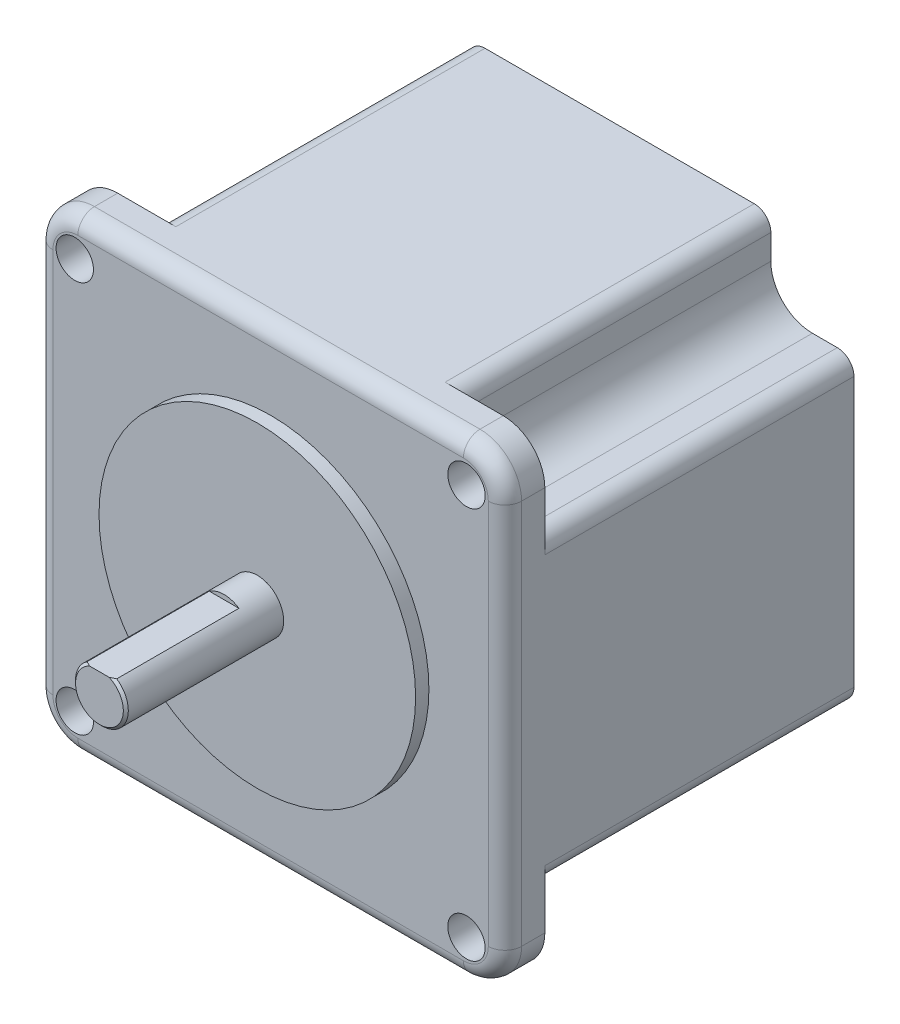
ISO-10303-21;
HEADER;
FILE_DESCRIPTION(('STEP AP214'),'2;1');
FILE_NAME('part.step','',(''),(''),'','','');
FILE_SCHEMA(('AUTOMOTIVE_DESIGN { 1 0 10303 214 1 1 1 1 }'));
ENDSEC;
DATA;
#1=APPLICATION_CONTEXT('core data for automotive mechanical design processes');
#2=APPLICATION_PROTOCOL_DEFINITION('international standard','automotive_design',2000,#1);
#3=PRODUCT_CONTEXT('',#1,'mechanical');
#4=PRODUCT('Part','Part','',(#3));
#5=PRODUCT_RELATED_PRODUCT_CATEGORY('part','',(#4));
#6=PRODUCT_DEFINITION_FORMATION('','',#4);
#7=PRODUCT_DEFINITION_CONTEXT('part definition',#1,'design');
#8=PRODUCT_DEFINITION('design','',#6,#7);
#9=PRODUCT_DEFINITION_SHAPE('','',#8);
#10=(LENGTH_UNIT() NAMED_UNIT(*) SI_UNIT(.MILLI.,.METRE.));
#11=(NAMED_UNIT(*) PLANE_ANGLE_UNIT() SI_UNIT($,.RADIAN.));
#12=(NAMED_UNIT(*) SI_UNIT($,.STERADIAN.) SOLID_ANGLE_UNIT());
#13=UNCERTAINTY_MEASURE_WITH_UNIT(LENGTH_MEASURE(1.E-05),#10,'distance_accuracy_value','');
#14=(GEOMETRIC_REPRESENTATION_CONTEXT(3) GLOBAL_UNCERTAINTY_ASSIGNED_CONTEXT((#13)) GLOBAL_UNIT_ASSIGNED_CONTEXT((#10,
#11,#12)) REPRESENTATION_CONTEXT('',''));
#15=CARTESIAN_POINT('',(0.,0.,0.));
#16=DIRECTION('',(0.,0.,1.));
#17=DIRECTION('',(1.,0.,0.));
#18=AXIS2_PLACEMENT_3D('',#15,#16,#17);
#19=CARTESIAN_POINT('',(0.,0.,0.));
#20=DIRECTION('',(0.,0.,1.));
#21=DIRECTION('',(1.,0.,0.));
#22=AXIS2_PLACEMENT_3D('',#19,#20,#21);
#23=PLANE('',#22);
#24=CARTESIAN_POINT('',(0.,0.,0.));
#25=DIRECTION('',(0.,0.,1.));
#26=DIRECTION('',(1.,0.,0.));
#27=AXIS2_PLACEMENT_3D('',#24,#25,#26);
#28=CIRCLE('',#27,19.05);
#29=CARTESIAN_POINT('',(19.05,0.,0.));
#30=VERTEX_POINT('',#29);
#31=EDGE_CURVE('E522',#30,#30,#28,.T.);
#32=ORIENTED_EDGE('',*,*,#31,.T.);
#33=EDGE_LOOP('',(#32));
#34=FACE_BOUND('',#33,.T.);
#35=CARTESIAN_POINT('',(0.,0.,0.));
#36=DIRECTION('',(0.,0.,1.));
#37=DIRECTION('',(1.,0.,0.));
#38=AXIS2_PLACEMENT_3D('',#35,#36,#37);
#39=CIRCLE('',#38,3.175);
#40=CARTESIAN_POINT('',(3.175,0.,0.));
#41=VERTEX_POINT('',#40);
#42=EDGE_CURVE('E519',#41,#41,#39,.T.);
#43=ORIENTED_EDGE('',*,*,#42,.F.);
#44=EDGE_LOOP('',(#43));
#45=FACE_BOUND('',#44,.T.);
#46=ADVANCED_FACE('F35',(#34,#45),#23,.T.);
#47=CARTESIAN_POINT('',(0.,0.,-1.6));
#48=DIRECTION('',(0.,0.,1.));
#49=DIRECTION('',(1.,0.,0.));
#50=AXIS2_PLACEMENT_3D('',#47,#48,#49);
#51=CYLINDRICAL_SURFACE('',#50,19.05);
#52=CARTESIAN_POINT('',(0.,0.,-1.6));
#53=DIRECTION('',(0.,0.,1.));
#54=DIRECTION('',(1.,0.,0.));
#55=AXIS2_PLACEMENT_3D('',#52,#53,#54);
#56=CIRCLE('',#55,19.05);
#57=CARTESIAN_POINT('',(19.05,0.,-1.6));
#58=VERTEX_POINT('',#57);
#59=EDGE_CURVE('E509',#58,#58,#56,.F.);
#60=ORIENTED_EDGE('',*,*,#59,.F.);
#61=EDGE_LOOP('',(#60));
#62=FACE_BOUND('',#61,.T.);
#63=ORIENTED_EDGE('',*,*,#31,.F.);
#64=EDGE_LOOP('',(#63));
#65=FACE_BOUND('',#64,.T.);
#66=ADVANCED_FACE('F362',(#62,#65),#51,.T.);
#67=CARTESIAN_POINT('',(0.,0.,19.));
#68=DIRECTION('',(0.,0.,-1.));
#69=DIRECTION('',(-1.,0.,0.));
#70=AXIS2_PLACEMENT_3D('',#67,#68,#69);
#71=CYLINDRICAL_SURFACE('',#70,3.175);
#72=DIRECTION('',(0.,0.,-1.));
#73=VECTOR('',#72,1.);
#74=CARTESIAN_POINT('',(1.78605710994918,2.625,19.));
#75=LINE('',#74,#73);
#76=CARTESIAN_POINT('',(1.78605710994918,2.625,4.));
#77=VERTEX_POINT('',#76);
#78=CARTESIAN_POINT('',(1.78605710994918,2.625,18.7));
#79=VERTEX_POINT('',#78);
#80=EDGE_CURVE('E515',#77,#79,#75,.F.);
#81=ORIENTED_EDGE('',*,*,#80,.T.);
#82=CARTESIAN_POINT('',(0.,0.,18.7));
#83=DIRECTION('',(0.,0.,1.));
#84=DIRECTION('',(1.,0.,0.));
#85=AXIS2_PLACEMENT_3D('',#82,#83,#84);
#86=CIRCLE('',#85,3.175);
#87=CARTESIAN_POINT('',(-1.78605710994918,2.625,18.7));
#88=VERTEX_POINT('',#87);
#89=EDGE_CURVE('E11',#79,#88,#86,.F.);
#90=ORIENTED_EDGE('',*,*,#89,.T.);
#91=DIRECTION('',(0.,0.,-1.));
#92=VECTOR('',#91,1.);
#93=CARTESIAN_POINT('',(-1.78605710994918,2.625,19.));
#94=LINE('',#93,#92);
#95=CARTESIAN_POINT('',(-1.78605710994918,2.625,4.));
#96=VERTEX_POINT('',#95);
#97=EDGE_CURVE('E517',#88,#96,#94,.T.);
#98=ORIENTED_EDGE('',*,*,#97,.T.);
#99=CARTESIAN_POINT('',(0.,0.,4.));
#100=DIRECTION('',(0.,0.,1.));
#101=DIRECTION('',(1.,0.,0.));
#102=AXIS2_PLACEMENT_3D('',#99,#100,#101);
#103=CIRCLE('',#102,3.175);
#104=EDGE_CURVE('E527',#77,#96,#103,.T.);
#105=ORIENTED_EDGE('',*,*,#104,.F.);
#106=EDGE_LOOP('',(#81,#90,#98,#105));
#107=FACE_BOUND('',#106,.T.);
#108=ORIENTED_EDGE('',*,*,#42,.T.);
#109=EDGE_LOOP('',(#108));
#110=FACE_BOUND('',#109,.T.);
#111=ADVANCED_FACE('F358',(#107,#110),#71,.T.);
#112=CARTESIAN_POINT('',(0.,0.,19.));
#113=DIRECTION('',(0.,0.,1.));
#114=DIRECTION('',(1.,0.,0.));
#115=AXIS2_PLACEMENT_3D('',#112,#113,#114);
#116=PLANE('',#115);
#117=DIRECTION('',(1.,0.,0.));
#118=VECTOR('',#117,1.);
#119=CARTESIAN_POINT('',(0.,2.625,19.));
#120=LINE('',#119,#118);
#121=CARTESIAN_POINT('',(-1.17260393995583,2.625,19.));
#122=VERTEX_POINT('',#121);
#123=CARTESIAN_POINT('',(1.17260393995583,2.625,19.));
#124=VERTEX_POINT('',#123);
#125=EDGE_CURVE('E525',#122,#124,#120,.T.);
#126=ORIENTED_EDGE('',*,*,#125,.F.);
#127=CARTESIAN_POINT('',(0.,0.,19.));
#128=DIRECTION('',(0.,0.,1.));
#129=DIRECTION('',(1.,0.,0.));
#130=AXIS2_PLACEMENT_3D('',#127,#128,#129);
#131=CIRCLE('',#130,2.87499999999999);
#132=EDGE_CURVE('E312',#122,#124,#131,.T.);
#133=ORIENTED_EDGE('',*,*,#132,.T.);
#134=EDGE_LOOP('',(#126,#133));
#135=FACE_BOUND('',#134,.T.);
#136=ADVANCED_FACE('F354',(#135),#116,.T.);
#137=CARTESIAN_POINT('',(0.,0.,4.));
#138=DIRECTION('',(0.,0.,1.));
#139=DIRECTION('',(1.,0.,0.));
#140=AXIS2_PLACEMENT_3D('',#137,#138,#139);
#141=PLANE('',#140);
#142=ORIENTED_EDGE('',*,*,#104,.T.);
#143=DIRECTION('',(1.,0.,0.));
#144=VECTOR('',#143,1.);
#145=CARTESIAN_POINT('',(-4.50065229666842,2.625,4.));
#146=LINE('',#145,#144);
#147=EDGE_CURVE('E512',#96,#77,#146,.T.);
#148=ORIENTED_EDGE('',*,*,#147,.T.);
#149=EDGE_LOOP('',(#142,#148));
#150=FACE_BOUND('',#149,.T.);
#151=ADVANCED_FACE('F352',(#150),#141,.T.);
#152=CARTESIAN_POINT('',(0.,2.625,4.));
#153=DIRECTION('',(0.,-1.,0.));
#154=DIRECTION('',(0.,0.,-1.));
#155=AXIS2_PLACEMENT_3D('',#152,#153,#154);
#156=PLANE('',#155);
#157=ORIENTED_EDGE('',*,*,#125,.T.);
#158=CARTESIAN_POINT('',(1.17260393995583,2.625,19.));
#159=CARTESIAN_POINT('',(1.22536416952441,2.625,18.9784772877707));
#160=CARTESIAN_POINT('',(1.27769536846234,2.625,18.9559264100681));
#161=CARTESIAN_POINT('',(1.38148707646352,2.625,18.9090288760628));
#162=CARTESIAN_POINT('',(1.43294838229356,2.625,18.8846839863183));
#163=CARTESIAN_POINT('',(1.53508217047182,2.625,18.8344201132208));
#164=CARTESIAN_POINT('',(1.58575477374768,2.625,18.8085013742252));
#165=CARTESIAN_POINT('',(1.68641811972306,2.625,18.7552545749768));
#166=CARTESIAN_POINT('',(1.73640815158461,2.625,18.7279251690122));
#167=CARTESIAN_POINT('',(1.78605710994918,2.625,18.7));
#168=B_SPLINE_CURVE_WITH_KNOTS('',3,(#158,#159,#160,#161,#162,#163,#164,#165,#166,#167),
.UNSPECIFIED.,.F.,.F.,(4,2,2,2,4),(0.,0.170920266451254,0.341674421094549,0.512402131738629,
0.683295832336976),.UNSPECIFIED.);
#169=EDGE_CURVE('E44',#124,#79,#168,.T.);
#170=ORIENTED_EDGE('',*,*,#169,.T.);
#171=ORIENTED_EDGE('',*,*,#80,.F.);
#172=ORIENTED_EDGE('',*,*,#147,.F.);
#173=ORIENTED_EDGE('',*,*,#97,.F.);
#174=CARTESIAN_POINT('',(-1.78605710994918,2.625,18.7));
#175=CARTESIAN_POINT('',(-1.73640815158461,2.625,18.7279251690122));
#176=CARTESIAN_POINT('',(-1.68641811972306,2.625,18.7552545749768));
#177=CARTESIAN_POINT('',(-1.58575477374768,2.625,18.8085013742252));
#178=CARTESIAN_POINT('',(-1.53508217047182,2.625,18.8344201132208));
#179=CARTESIAN_POINT('',(-1.43294838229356,2.625,18.8846839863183));
#180=CARTESIAN_POINT('',(-1.38148707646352,2.625,18.9090288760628));
#181=CARTESIAN_POINT('',(-1.27769536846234,2.625,18.9559264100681));
#182=CARTESIAN_POINT('',(-1.22536416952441,2.625,18.9784772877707));
#183=CARTESIAN_POINT('',(-1.17260393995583,2.625,19.));
#184=B_SPLINE_CURVE_WITH_KNOTS('',3,(#174,#175,#176,#177,#178,#179,#180,#181,#182,#183),
.UNSPECIFIED.,.F.,.F.,(4,2,2,2,4),(0.,0.170893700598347,0.341621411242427,0.512375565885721,
0.683295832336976),.UNSPECIFIED.);
#185=EDGE_CURVE('E316',#88,#122,#184,.T.);
#186=ORIENTED_EDGE('',*,*,#185,.T.);
#187=EDGE_LOOP('',(#157,#170,#171,#172,#173,#186));
#188=FACE_BOUND('',#187,.T.);
#189=ADVANCED_FACE('F346',(#188),#156,.F.);
#190=CARTESIAN_POINT('',(23.2,-23.2,-43.6));
#191=DIRECTION('',(0.,0.,1.));
#192=DIRECTION('',(1.,0.,0.));
#193=AXIS2_PLACEMENT_3D('',#190,#191,#192);
#194=CYLINDRICAL_SURFACE('',#193,5.);
#195=DIRECTION('',(0.,0.,1.));
#196=VECTOR('',#195,1.);
#197=CARTESIAN_POINT('',(23.2,-28.2,-43.6));
#198=LINE('',#197,#196);
#199=CARTESIAN_POINT('',(23.2,-28.2,-6.4));
#200=VERTEX_POINT('',#199);
#201=CARTESIAN_POINT('',(23.2,-28.2,-3.60000000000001));
#202=VERTEX_POINT('',#201);
#203=EDGE_CURVE('E507',#200,#202,#198,.T.);
#204=ORIENTED_EDGE('',*,*,#203,.F.);
#205=CARTESIAN_POINT('',(23.2,-23.2,-6.4));
#206=DIRECTION('',(0.,0.,1.));
#207=DIRECTION('',(1.,0.,0.));
#208=AXIS2_PLACEMENT_3D('',#205,#206,#207);
#209=CIRCLE('',#208,5.);
#210=CARTESIAN_POINT('',(28.2,-23.2,-6.4));
#211=VERTEX_POINT('',#210);
#212=EDGE_CURVE('E547',#200,#211,#209,.T.);
#213=ORIENTED_EDGE('',*,*,#212,.T.);
#214=DIRECTION('',(0.,0.,1.));
#215=VECTOR('',#214,1.);
#216=CARTESIAN_POINT('',(28.2,-23.2,-43.6));
#217=LINE('',#216,#215);
#218=CARTESIAN_POINT('',(28.2,-23.2,-3.60000000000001));
#219=VERTEX_POINT('',#218);
#220=EDGE_CURVE('E311',#211,#219,#217,.T.);
#221=ORIENTED_EDGE('',*,*,#220,.T.);
#222=CARTESIAN_POINT('',(23.2,-23.2,-3.59999999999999));
#223=DIRECTION('',(0.,0.,1.));
#224=DIRECTION('',(1.,0.,0.));
#225=AXIS2_PLACEMENT_3D('',#222,#223,#224);
#226=CIRCLE('',#225,5.);
#227=EDGE_CURVE('E455',#219,#202,#226,.F.);
#228=ORIENTED_EDGE('',*,*,#227,.T.);
#229=EDGE_LOOP('',(#204,#213,#221,#228));
#230=FACE_BOUND('',#229,.T.);
#231=ADVANCED_FACE('F351',(#230),#194,.T.);
#232=CARTESIAN_POINT('',(-23.2,-28.2,-43.6));
#233=DIRECTION('',(0.,1.,0.));
#234=DIRECTION('',(-1.,0.,0.));
#235=AXIS2_PLACEMENT_3D('',#232,#233,#234);
#236=PLANE('',#235);
#237=DIRECTION('',(0.,0.,-1.));
#238=VECTOR('',#237,1.);
#239=CARTESIAN_POINT('',(-16.2,-28.2,-6.4));
#240=LINE('',#239,#238);
#241=CARTESIAN_POINT('',(-16.2,-28.2,-6.4));
#242=VERTEX_POINT('',#241);
#243=CARTESIAN_POINT('',(-16.2,-28.2,-43.6));
#244=VERTEX_POINT('',#243);
#245=EDGE_CURVE('E594',#242,#244,#240,.T.);
#246=ORIENTED_EDGE('',*,*,#245,.T.);
#247=DIRECTION('',(-1.,0.,0.));
#248=VECTOR('',#247,1.);
#249=CARTESIAN_POINT('',(-23.2,-28.2,-43.6));
#250=LINE('',#249,#248);
#251=CARTESIAN_POINT('',(16.2,-28.2,-43.6));
#252=VERTEX_POINT('',#251);
#253=EDGE_CURVE('E475',#252,#244,#250,.T.);
#254=ORIENTED_EDGE('',*,*,#253,.F.);
#255=DIRECTION('',(0.,0.,-1.));
#256=VECTOR('',#255,1.);
#257=CARTESIAN_POINT('',(16.2,-28.2,-6.4));
#258=LINE('',#257,#256);
#259=CARTESIAN_POINT('',(16.2,-28.2,-6.4));
#260=VERTEX_POINT('',#259);
#261=EDGE_CURVE('E295',#260,#252,#258,.T.);
#262=ORIENTED_EDGE('',*,*,#261,.F.);
#263=DIRECTION('',(1.,0.,0.));
#264=VECTOR('',#263,1.);
#265=CARTESIAN_POINT('',(-23.2,-28.2,-6.4));
#266=LINE('',#265,#264);
#267=EDGE_CURVE('E549',#260,#200,#266,.T.);
#268=ORIENTED_EDGE('',*,*,#267,.T.);
#269=ORIENTED_EDGE('',*,*,#203,.T.);
#270=DIRECTION('',(-1.,0.,0.));
#271=VECTOR('',#270,1.);
#272=CARTESIAN_POINT('',(-23.2,-28.2,-3.6));
#273=LINE('',#272,#271);
#274=CARTESIAN_POINT('',(-23.2,-28.2,-3.60000000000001));
#275=VERTEX_POINT('',#274);
#276=EDGE_CURVE('E530',#202,#275,#273,.T.);
#277=ORIENTED_EDGE('',*,*,#276,.T.);
#278=DIRECTION('',(0.,0.,1.));
#279=VECTOR('',#278,1.);
#280=CARTESIAN_POINT('',(-23.2,-28.2,-43.6));
#281=LINE('',#280,#279);
#282=CARTESIAN_POINT('',(-23.2,-28.2,-6.4));
#283=VERTEX_POINT('',#282);
#284=EDGE_CURVE('E505',#283,#275,#281,.T.);
#285=ORIENTED_EDGE('',*,*,#284,.F.);
#286=DIRECTION('',(1.,0.,0.));
#287=VECTOR('',#286,1.);
#288=CARTESIAN_POINT('',(-23.2,-28.2,-6.4));
#289=LINE('',#288,#287);
#290=EDGE_CURVE('E603',#283,#242,#289,.T.);
#291=ORIENTED_EDGE('',*,*,#290,.T.);
#292=EDGE_LOOP('',(#246,#254,#262,#268,#269,#277,#285,#291));
#293=FACE_BOUND('',#292,.T.);
#294=ADVANCED_FACE('F743',(#293),#236,.F.);
#295=CARTESIAN_POINT('',(-23.2,-23.2,-43.6));
#296=DIRECTION('',(0.,0.,1.));
#297=DIRECTION('',(1.,0.,0.));
#298=AXIS2_PLACEMENT_3D('',#295,#296,#297);
#299=CYLINDRICAL_SURFACE('',#298,5.);
#300=DIRECTION('',(0.,0.,1.));
#301=VECTOR('',#300,1.);
#302=CARTESIAN_POINT('',(-28.2,-23.2,-43.6));
#303=LINE('',#302,#301);
#304=CARTESIAN_POINT('',(-28.2,-23.2,-6.4));
#305=VERTEX_POINT('',#304);
#306=CARTESIAN_POINT('',(-28.2,-23.2,-3.60000000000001));
#307=VERTEX_POINT('',#306);
#308=EDGE_CURVE('E503',#305,#307,#303,.T.);
#309=ORIENTED_EDGE('',*,*,#308,.F.);
#310=CARTESIAN_POINT('',(-23.2,-23.2,-6.4));
#311=DIRECTION('',(0.,0.,1.));
#312=DIRECTION('',(1.,0.,0.));
#313=AXIS2_PLACEMENT_3D('',#310,#311,#312);
#314=CIRCLE('',#313,5.);
#315=EDGE_CURVE('E589',#305,#283,#314,.T.);
#316=ORIENTED_EDGE('',*,*,#315,.T.);
#317=ORIENTED_EDGE('',*,*,#284,.T.);
#318=CARTESIAN_POINT('',(-23.2,-23.2,-3.59999999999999));
#319=DIRECTION('',(0.,0.,1.));
#320=DIRECTION('',(1.,0.,0.));
#321=AXIS2_PLACEMENT_3D('',#318,#319,#320);
#322=CIRCLE('',#321,5.);
#323=EDGE_CURVE('E440',#275,#307,#322,.F.);
#324=ORIENTED_EDGE('',*,*,#323,.T.);
#325=EDGE_LOOP('',(#309,#316,#317,#324));
#326=FACE_BOUND('',#325,.T.);
#327=ADVANCED_FACE('F874',(#326),#299,.T.);
#328=CARTESIAN_POINT('',(-28.2,23.2,-43.6));
#329=DIRECTION('',(1.,0.,0.));
#330=DIRECTION('',(0.,1.,0.));
#331=AXIS2_PLACEMENT_3D('',#328,#329,#330);
#332=PLANE('',#331);
#333=DIRECTION('',(0.,0.,-1.));
#334=VECTOR('',#333,1.);
#335=CARTESIAN_POINT('',(-28.2,16.2,-6.4));
#336=LINE('',#335,#334);
#337=CARTESIAN_POINT('',(-28.2,16.2,-6.4));
#338=VERTEX_POINT('',#337);
#339=CARTESIAN_POINT('',(-28.2,16.2,-43.6));
#340=VERTEX_POINT('',#339);
#341=EDGE_CURVE('E682',#338,#340,#336,.T.);
#342=ORIENTED_EDGE('',*,*,#341,.T.);
#343=DIRECTION('',(0.,1.,0.));
#344=VECTOR('',#343,1.);
#345=CARTESIAN_POINT('',(-28.2,23.2,-43.6));
#346=LINE('',#345,#344);
#347=CARTESIAN_POINT('',(-28.2,-16.2,-43.6));
#348=VERTEX_POINT('',#347);
#349=EDGE_CURVE('E700',#348,#340,#346,.T.);
#350=ORIENTED_EDGE('',*,*,#349,.F.);
#351=DIRECTION('',(0.,0.,-1.));
#352=VECTOR('',#351,1.);
#353=CARTESIAN_POINT('',(-28.2,-16.2,-6.4));
#354=LINE('',#353,#352);
#355=CARTESIAN_POINT('',(-28.2,-16.2,-6.4));
#356=VERTEX_POINT('',#355);
#357=EDGE_CURVE('E592',#356,#348,#354,.T.);
#358=ORIENTED_EDGE('',*,*,#357,.F.);
#359=DIRECTION('',(0.,-1.,0.));
#360=VECTOR('',#359,1.);
#361=CARTESIAN_POINT('',(-28.2,23.2,-6.4));
#362=LINE('',#361,#360);
#363=EDGE_CURVE('E313',#356,#305,#362,.T.);
#364=ORIENTED_EDGE('',*,*,#363,.T.);
#365=ORIENTED_EDGE('',*,*,#308,.T.);
#366=DIRECTION('',(0.,1.,0.));
#367=VECTOR('',#366,1.);
#368=CARTESIAN_POINT('',(-28.2,23.2,-3.6));
#369=LINE('',#368,#367);
#370=CARTESIAN_POINT('',(-28.2,23.2,-3.60000000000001));
#371=VERTEX_POINT('',#370);
#372=EDGE_CURVE('E443',#307,#371,#369,.T.);
#373=ORIENTED_EDGE('',*,*,#372,.T.);
#374=DIRECTION('',(0.,0.,1.));
#375=VECTOR('',#374,1.);
#376=CARTESIAN_POINT('',(-28.2,23.2,-43.6));
#377=LINE('',#376,#375);
#378=CARTESIAN_POINT('',(-28.2,23.2,-6.4));
#379=VERTEX_POINT('',#378);
#380=EDGE_CURVE('E501',#379,#371,#377,.T.);
#381=ORIENTED_EDGE('',*,*,#380,.F.);
#382=DIRECTION('',(0.,-1.,0.));
#383=VECTOR('',#382,1.);
#384=CARTESIAN_POINT('',(-28.2,23.2,-6.4));
#385=LINE('',#384,#383);
#386=EDGE_CURVE('E463',#379,#338,#385,.T.);
#387=ORIENTED_EDGE('',*,*,#386,.T.);
#388=EDGE_LOOP('',(#342,#350,#358,#364,#365,#373,#381,#387));
#389=FACE_BOUND('',#388,.T.);
#390=ADVANCED_FACE('F871',(#389),#332,.F.);
#391=CARTESIAN_POINT('',(-23.2,23.2,-43.6));
#392=DIRECTION('',(0.,0.,1.));
#393=DIRECTION('',(1.,0.,0.));
#394=AXIS2_PLACEMENT_3D('',#391,#392,#393);
#395=CYLINDRICAL_SURFACE('',#394,5.);
#396=DIRECTION('',(0.,0.,1.));
#397=VECTOR('',#396,1.);
#398=CARTESIAN_POINT('',(-23.2,28.2,-43.6));
#399=LINE('',#398,#397);
#400=CARTESIAN_POINT('',(-23.2,28.2,-6.4));
#401=VERTEX_POINT('',#400);
#402=CARTESIAN_POINT('',(-23.2,28.2,-3.60000000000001));
#403=VERTEX_POINT('',#402);
#404=EDGE_CURVE('E494',#401,#403,#399,.T.);
#405=ORIENTED_EDGE('',*,*,#404,.F.);
#406=CARTESIAN_POINT('',(-23.2,23.2,-6.4));
#407=DIRECTION('',(0.,0.,1.));
#408=DIRECTION('',(1.,0.,0.));
#409=AXIS2_PLACEMENT_3D('',#406,#407,#408);
#410=CIRCLE('',#409,5.);
#411=EDGE_CURVE('E685',#401,#379,#410,.T.);
#412=ORIENTED_EDGE('',*,*,#411,.T.);
#413=ORIENTED_EDGE('',*,*,#380,.T.);
#414=CARTESIAN_POINT('',(-23.2,23.2,-3.59999999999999));
#415=DIRECTION('',(0.,0.,1.));
#416=DIRECTION('',(1.,0.,0.));
#417=AXIS2_PLACEMENT_3D('',#414,#415,#416);
#418=CIRCLE('',#417,5.);
#419=EDGE_CURVE('E446',#371,#403,#418,.F.);
#420=ORIENTED_EDGE('',*,*,#419,.T.);
#421=EDGE_LOOP('',(#405,#412,#413,#420));
#422=FACE_BOUND('',#421,.T.);
#423=ADVANCED_FACE('F731',(#422),#395,.T.);
#424=CARTESIAN_POINT('',(23.2,28.2,-43.6));
#425=DIRECTION('',(0.,-1.,0.));
#426=DIRECTION('',(0.,0.,-1.));
#427=AXIS2_PLACEMENT_3D('',#424,#425,#426);
#428=PLANE('',#427);
#429=DIRECTION('',(0.,0.,-1.));
#430=VECTOR('',#429,1.);
#431=CARTESIAN_POINT('',(16.2,28.2,-6.4));
#432=LINE('',#431,#430);
#433=CARTESIAN_POINT('',(16.2,28.2,-6.4));
#434=VERTEX_POINT('',#433);
#435=CARTESIAN_POINT('',(16.2,28.2,-43.6));
#436=VERTEX_POINT('',#435);
#437=EDGE_CURVE('E640',#434,#436,#432,.T.);
#438=ORIENTED_EDGE('',*,*,#437,.T.);
#439=DIRECTION('',(1.,0.,0.));
#440=VECTOR('',#439,1.);
#441=CARTESIAN_POINT('',(0.,28.2,-43.6));
#442=LINE('',#441,#440);
#443=CARTESIAN_POINT('',(-16.2,28.2,-43.6));
#444=VERTEX_POINT('',#443);
#445=EDGE_CURVE('E702',#444,#436,#442,.T.);
#446=ORIENTED_EDGE('',*,*,#445,.F.);
#447=DIRECTION('',(0.,0.,-1.));
#448=VECTOR('',#447,1.);
#449=CARTESIAN_POINT('',(-16.2,28.2,-6.4));
#450=LINE('',#449,#448);
#451=CARTESIAN_POINT('',(-16.2,28.2,-6.4));
#452=VERTEX_POINT('',#451);
#453=EDGE_CURVE('E668',#452,#444,#450,.T.);
#454=ORIENTED_EDGE('',*,*,#453,.F.);
#455=DIRECTION('',(-1.,0.,0.));
#456=VECTOR('',#455,1.);
#457=CARTESIAN_POINT('',(23.2,28.2,-6.4));
#458=LINE('',#457,#456);
#459=EDGE_CURVE('E458',#452,#401,#458,.T.);
#460=ORIENTED_EDGE('',*,*,#459,.T.);
#461=ORIENTED_EDGE('',*,*,#404,.T.);
#462=DIRECTION('',(1.,0.,0.));
#463=VECTOR('',#462,1.);
#464=CARTESIAN_POINT('',(23.2,28.2,-3.6));
#465=LINE('',#464,#463);
#466=CARTESIAN_POINT('',(23.2,28.2,-3.60000000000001));
#467=VERTEX_POINT('',#466);
#468=EDGE_CURVE('E417',#403,#467,#465,.T.);
#469=ORIENTED_EDGE('',*,*,#468,.T.);
#470=DIRECTION('',(0.,0.,1.));
#471=VECTOR('',#470,1.);
#472=CARTESIAN_POINT('',(23.2,28.2,-43.6));
#473=LINE('',#472,#471);
#474=CARTESIAN_POINT('',(23.2,28.2,-6.4));
#475=VERTEX_POINT('',#474);
#476=EDGE_CURVE('E492',#475,#467,#473,.T.);
#477=ORIENTED_EDGE('',*,*,#476,.F.);
#478=DIRECTION('',(-1.,0.,0.));
#479=VECTOR('',#478,1.);
#480=CARTESIAN_POINT('',(23.2,28.2,-6.4));
#481=LINE('',#480,#479);
#482=EDGE_CURVE('E648',#475,#434,#481,.T.);
#483=ORIENTED_EDGE('',*,*,#482,.T.);
#484=EDGE_LOOP('',(#438,#446,#454,#460,#461,#469,#477,#483));
#485=FACE_BOUND('',#484,.T.);
#486=ADVANCED_FACE('F727',(#485),#428,.F.);
#487=CARTESIAN_POINT('',(23.2,23.2,-43.6));
#488=DIRECTION('',(0.,0.,1.));
#489=DIRECTION('',(1.,0.,0.));
#490=AXIS2_PLACEMENT_3D('',#487,#488,#489);
#491=CYLINDRICAL_SURFACE('',#490,5.);
#492=DIRECTION('',(0.,0.,1.));
#493=VECTOR('',#492,1.);
#494=CARTESIAN_POINT('',(28.2,23.2,-43.6));
#495=LINE('',#494,#493);
#496=CARTESIAN_POINT('',(28.2,23.2,-6.4));
#497=VERTEX_POINT('',#496);
#498=CARTESIAN_POINT('',(28.2,23.2,-3.60000000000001));
#499=VERTEX_POINT('',#498);
#500=EDGE_CURVE('E480',#497,#499,#495,.T.);
#501=ORIENTED_EDGE('',*,*,#500,.F.);
#502=CARTESIAN_POINT('',(23.2,23.2,-6.4));
#503=DIRECTION('',(0.,0.,1.));
#504=DIRECTION('',(1.,0.,0.));
#505=AXIS2_PLACEMENT_3D('',#502,#503,#504);
#506=CIRCLE('',#505,5.);
#507=EDGE_CURVE('E488',#497,#475,#506,.T.);
#508=ORIENTED_EDGE('',*,*,#507,.T.);
#509=ORIENTED_EDGE('',*,*,#476,.T.);
#510=CARTESIAN_POINT('',(23.2,23.2,-3.59999999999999));
#511=DIRECTION('',(0.,0.,1.));
#512=DIRECTION('',(1.,0.,0.));
#513=AXIS2_PLACEMENT_3D('',#510,#511,#512);
#514=CIRCLE('',#513,5.);
#515=EDGE_CURVE('E450',#467,#499,#514,.F.);
#516=ORIENTED_EDGE('',*,*,#515,.T.);
#517=EDGE_LOOP('',(#501,#508,#509,#516));
#518=FACE_BOUND('',#517,.T.);
#519=ADVANCED_FACE('F487',(#518),#491,.T.);
#520=CARTESIAN_POINT('',(28.2,-23.2,-43.6));
#521=DIRECTION('',(-1.,0.,0.));
#522=DIRECTION('',(0.,0.,1.));
#523=AXIS2_PLACEMENT_3D('',#520,#521,#522);
#524=PLANE('',#523);
#525=DIRECTION('',(0.,0.,-1.));
#526=VECTOR('',#525,1.);
#527=CARTESIAN_POINT('',(28.2,-16.2,-6.4));
#528=LINE('',#527,#526);
#529=CARTESIAN_POINT('',(28.2,-16.2,-6.4));
#530=VERTEX_POINT('',#529);
#531=CARTESIAN_POINT('',(28.2,-16.2,-43.6));
#532=VERTEX_POINT('',#531);
#533=EDGE_CURVE('E285',#530,#532,#528,.T.);
#534=ORIENTED_EDGE('',*,*,#533,.T.);
#535=DIRECTION('',(0.,-1.,0.));
#536=VECTOR('',#535,1.);
#537=CARTESIAN_POINT('',(28.2,-23.2,-43.6));
#538=LINE('',#537,#536);
#539=CARTESIAN_POINT('',(28.2,16.2,-43.6));
#540=VERTEX_POINT('',#539);
#541=EDGE_CURVE('E496',#540,#532,#538,.T.);
#542=ORIENTED_EDGE('',*,*,#541,.F.);
#543=DIRECTION('',(0.,0.,-1.));
#544=VECTOR('',#543,1.);
#545=CARTESIAN_POINT('',(28.2,16.2,-6.4));
#546=LINE('',#545,#544);
#547=CARTESIAN_POINT('',(28.2,16.2,-6.4));
#548=VERTEX_POINT('',#547);
#549=EDGE_CURVE('E481',#548,#540,#546,.T.);
#550=ORIENTED_EDGE('',*,*,#549,.F.);
#551=DIRECTION('',(0.,1.,0.));
#552=VECTOR('',#551,1.);
#553=CARTESIAN_POINT('',(28.2,-23.2,-6.4));
#554=LINE('',#553,#552);
#555=EDGE_CURVE('E319',#548,#497,#554,.T.);
#556=ORIENTED_EDGE('',*,*,#555,.T.);
#557=ORIENTED_EDGE('',*,*,#500,.T.);
#558=DIRECTION('',(0.,-1.,0.));
#559=VECTOR('',#558,1.);
#560=CARTESIAN_POINT('',(28.2,-23.2,-3.6));
#561=LINE('',#560,#559);
#562=EDGE_CURVE('E453',#499,#219,#561,.T.);
#563=ORIENTED_EDGE('',*,*,#562,.T.);
#564=ORIENTED_EDGE('',*,*,#220,.F.);
#565=DIRECTION('',(0.,1.,0.));
#566=VECTOR('',#565,1.);
#567=CARTESIAN_POINT('',(28.2,-23.2,-6.4));
#568=LINE('',#567,#566);
#569=EDGE_CURVE('E301',#211,#530,#568,.T.);
#570=ORIENTED_EDGE('',*,*,#569,.T.);
#571=EDGE_LOOP('',(#534,#542,#550,#556,#557,#563,#564,#570));
#572=FACE_BOUND('',#571,.T.);
#573=ADVANCED_FACE('F309',(#572),#524,.F.);
#574=CARTESIAN_POINT('',(23.2,-23.2,-43.6));
#575=DIRECTION('',(0.,0.,1.));
#576=DIRECTION('',(1.,0.,0.));
#577=AXIS2_PLACEMENT_3D('',#574,#575,#576);
#578=PLANE('',#577);
#579=ORIENTED_EDGE('',*,*,#541,.T.);
#580=CARTESIAN_POINT('',(26.2,-16.2,-43.6));
#581=DIRECTION('',(0.,0.,1.));
#582=DIRECTION('',(1.,0.,0.));
#583=AXIS2_PLACEMENT_3D('',#580,#581,#582);
#584=CIRCLE('',#583,2.);
#585=CARTESIAN_POINT('',(26.2,-18.2,-43.6));
#586=VERTEX_POINT('',#585);
#587=EDGE_CURVE('E291',#586,#532,#584,.T.);
#588=ORIENTED_EDGE('',*,*,#587,.F.);
#589=DIRECTION('',(1.,0.,0.));
#590=VECTOR('',#589,1.);
#591=CARTESIAN_POINT('',(23.2,-18.2,-43.6));
#592=LINE('',#591,#590);
#593=CARTESIAN_POINT('',(23.2,-18.2,-43.6));
#594=VERTEX_POINT('',#593);
#595=EDGE_CURVE('E306',#594,#586,#592,.T.);
#596=ORIENTED_EDGE('',*,*,#595,.F.);
#597=CARTESIAN_POINT('',(23.2,-23.2,-43.6));
#598=DIRECTION('',(0.,0.,-1.));
#599=DIRECTION('',(-1.,0.,0.));
#600=AXIS2_PLACEMENT_3D('',#597,#598,#599);
#601=CIRCLE('',#600,5.);
#602=CARTESIAN_POINT('',(18.2,-23.2000000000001,-43.6));
#603=VERTEX_POINT('',#602);
#604=EDGE_CURVE('E768',#603,#594,#601,.T.);
#605=ORIENTED_EDGE('',*,*,#604,.F.);
#606=DIRECTION('',(0.,1.,0.));
#607=VECTOR('',#606,1.);
#608=CARTESIAN_POINT('',(18.2,-26.2,-43.6));
#609=LINE('',#608,#607);
#610=CARTESIAN_POINT('',(18.2,-26.2,-43.6));
#611=VERTEX_POINT('',#610);
#612=EDGE_CURVE('E765',#611,#603,#609,.T.);
#613=ORIENTED_EDGE('',*,*,#612,.F.);
#614=CARTESIAN_POINT('',(16.2,-26.2,-43.6));
#615=DIRECTION('',(0.,0.,1.));
#616=DIRECTION('',(1.,0.,0.));
#617=AXIS2_PLACEMENT_3D('',#614,#615,#616);
#618=CIRCLE('',#617,1.99999999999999);
#619=EDGE_CURVE('E763',#252,#611,#618,.T.);
#620=ORIENTED_EDGE('',*,*,#619,.F.);
#621=ORIENTED_EDGE('',*,*,#253,.T.);
#622=CARTESIAN_POINT('',(-16.2,-26.2,-43.6));
#623=DIRECTION('',(0.,0.,1.));
#624=DIRECTION('',(-1.,0.,0.));
#625=AXIS2_PLACEMENT_3D('',#622,#623,#624);
#626=CIRCLE('',#625,2.);
#627=CARTESIAN_POINT('',(-18.2,-26.2,-43.6));
#628=VERTEX_POINT('',#627);
#629=EDGE_CURVE('E579',#628,#244,#626,.T.);
#630=ORIENTED_EDGE('',*,*,#629,.F.);
#631=DIRECTION('',(0.,-1.,0.));
#632=VECTOR('',#631,1.);
#633=CARTESIAN_POINT('',(-18.2,-26.2,-43.6));
#634=LINE('',#633,#632);
#635=CARTESIAN_POINT('',(-18.2,-23.2,-43.6));
#636=VERTEX_POINT('',#635);
#637=EDGE_CURVE('E576',#636,#628,#634,.T.);
#638=ORIENTED_EDGE('',*,*,#637,.F.);
#639=CARTESIAN_POINT('',(-23.2,-23.2,-43.6));
#640=DIRECTION('',(0.,0.,-1.));
#641=DIRECTION('',(1.,0.,0.));
#642=AXIS2_PLACEMENT_3D('',#639,#640,#641);
#643=CIRCLE('',#642,5.);
#644=CARTESIAN_POINT('',(-23.2,-18.2,-43.6));
#645=VERTEX_POINT('',#644);
#646=EDGE_CURVE('E552',#645,#636,#643,.T.);
#647=ORIENTED_EDGE('',*,*,#646,.F.);
#648=DIRECTION('',(1.,0.,0.));
#649=VECTOR('',#648,1.);
#650=CARTESIAN_POINT('',(-23.2,-18.2,-43.6));
#651=LINE('',#650,#649);
#652=CARTESIAN_POINT('',(-26.2,-18.2,-43.6));
#653=VERTEX_POINT('',#652);
#654=EDGE_CURVE('E562',#653,#645,#651,.T.);
#655=ORIENTED_EDGE('',*,*,#654,.F.);
#656=CARTESIAN_POINT('',(-26.2,-16.2,-43.6));
#657=DIRECTION('',(0.,0.,1.));
#658=DIRECTION('',(-1.,0.,0.));
#659=AXIS2_PLACEMENT_3D('',#656,#657,#658);
#660=CIRCLE('',#659,2.);
#661=EDGE_CURVE('E582',#348,#653,#660,.T.);
#662=ORIENTED_EDGE('',*,*,#661,.F.);
#663=ORIENTED_EDGE('',*,*,#349,.T.);
#664=CARTESIAN_POINT('',(-26.2,16.2,-43.6));
#665=DIRECTION('',(0.,0.,1.));
#666=DIRECTION('',(1.,0.,0.));
#667=AXIS2_PLACEMENT_3D('',#664,#665,#666);
#668=CIRCLE('',#667,2.);
#669=CARTESIAN_POINT('',(-26.2,18.2,-43.6));
#670=VERTEX_POINT('',#669);
#671=EDGE_CURVE('E656',#670,#340,#668,.T.);
#672=ORIENTED_EDGE('',*,*,#671,.F.);
#673=DIRECTION('',(-1.,0.,0.));
#674=VECTOR('',#673,1.);
#675=CARTESIAN_POINT('',(-23.2,18.2,-43.6));
#676=LINE('',#675,#674);
#677=CARTESIAN_POINT('',(-23.2,18.2,-43.6));
#678=VERTEX_POINT('',#677);
#679=EDGE_CURVE('E677',#678,#670,#676,.T.);
#680=ORIENTED_EDGE('',*,*,#679,.F.);
#681=CARTESIAN_POINT('',(-23.2,23.2,-43.6));
#682=DIRECTION('',(0.,0.,-1.));
#683=DIRECTION('',(-1.,0.,0.));
#684=AXIS2_PLACEMENT_3D('',#681,#682,#683);
#685=CIRCLE('',#684,5.);
#686=CARTESIAN_POINT('',(-18.2,23.2,-43.6));
#687=VERTEX_POINT('',#686);
#688=EDGE_CURVE('E674',#687,#678,#685,.T.);
#689=ORIENTED_EDGE('',*,*,#688,.F.);
#690=DIRECTION('',(0.,-1.,0.));
#691=VECTOR('',#690,1.);
#692=CARTESIAN_POINT('',(-18.2,26.2,-43.6));
#693=LINE('',#692,#691);
#694=CARTESIAN_POINT('',(-18.2,26.2,-43.6));
#695=VERTEX_POINT('',#694);
#696=EDGE_CURVE('E671',#695,#687,#693,.T.);
#697=ORIENTED_EDGE('',*,*,#696,.F.);
#698=CARTESIAN_POINT('',(-16.2,26.2,-43.6));
#699=DIRECTION('',(0.,0.,1.));
#700=DIRECTION('',(1.,0.,0.));
#701=AXIS2_PLACEMENT_3D('',#698,#699,#700);
#702=CIRCLE('',#701,2.);
#703=EDGE_CURVE('E651',#444,#695,#702,.T.);
#704=ORIENTED_EDGE('',*,*,#703,.F.);
#705=ORIENTED_EDGE('',*,*,#445,.T.);
#706=CARTESIAN_POINT('',(16.2,26.2,-43.6));
#707=DIRECTION('',(0.,0.,1.));
#708=DIRECTION('',(-1.,0.,0.));
#709=AXIS2_PLACEMENT_3D('',#706,#707,#708);
#710=CIRCLE('',#709,1.99999999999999);
#711=CARTESIAN_POINT('',(18.2,26.2,-43.6));
#712=VERTEX_POINT('',#711);
#713=EDGE_CURVE('E627',#712,#436,#710,.T.);
#714=ORIENTED_EDGE('',*,*,#713,.F.);
#715=DIRECTION('',(0.,1.,0.));
#716=VECTOR('',#715,1.);
#717=CARTESIAN_POINT('',(18.2,26.2,-43.6));
#718=LINE('',#717,#716);
#719=CARTESIAN_POINT('',(18.2,23.2,-43.6));
#720=VERTEX_POINT('',#719);
#721=EDGE_CURVE('E624',#720,#712,#718,.T.);
#722=ORIENTED_EDGE('',*,*,#721,.F.);
#723=CARTESIAN_POINT('',(23.2,23.2,-43.6));
#724=DIRECTION('',(0.,0.,-1.));
#725=DIRECTION('',(1.,0.,0.));
#726=AXIS2_PLACEMENT_3D('',#723,#724,#725);
#727=CIRCLE('',#726,5.);
#728=CARTESIAN_POINT('',(23.2,18.2,-43.6));
#729=VERTEX_POINT('',#728);
#730=EDGE_CURVE('E606',#729,#720,#727,.T.);
#731=ORIENTED_EDGE('',*,*,#730,.F.);
#732=DIRECTION('',(-1.,0.,0.));
#733=VECTOR('',#732,1.);
#734=CARTESIAN_POINT('',(23.2,18.2,-43.6));
#735=LINE('',#734,#733);
#736=CARTESIAN_POINT('',(26.2,18.2,-43.6));
#737=VERTEX_POINT('',#736);
#738=EDGE_CURVE('E611',#737,#729,#735,.T.);
#739=ORIENTED_EDGE('',*,*,#738,.F.);
#740=CARTESIAN_POINT('',(26.2,16.2,-43.6));
#741=DIRECTION('',(0.,0.,1.));
#742=DIRECTION('',(-1.,0.,0.));
#743=AXIS2_PLACEMENT_3D('',#740,#741,#742);
#744=CIRCLE('',#743,2.);
#745=EDGE_CURVE('E630',#540,#737,#744,.T.);
#746=ORIENTED_EDGE('',*,*,#745,.F.);
#747=EDGE_LOOP('',(#579,#588,#596,#605,#613,#620,#621,#630,#638,#647,#655,#662,#663,#672,#680,
#689,#697,#704,#705,#714,#722,#731,#739,#746));
#748=FACE_BOUND('',#747,.T.);
#749=ADVANCED_FACE('F404',(#748),#578,.F.);
#750=CARTESIAN_POINT('',(23.2,-23.2,-1.6));
#751=DIRECTION('',(0.,0.,1.));
#752=DIRECTION('',(1.,0.,0.));
#753=AXIS2_PLACEMENT_3D('',#750,#751,#752);
#754=PLANE('',#753);
#755=CARTESIAN_POINT('',(-23.57,-23.57,-1.6));
#756=DIRECTION('',(0.,0.,1.));
#757=DIRECTION('',(1.,0.,0.));
#758=AXIS2_PLACEMENT_3D('',#755,#756,#757);
#759=CIRCLE('',#758,2.25);
#760=CARTESIAN_POINT('',(-21.32,-23.57,-1.6));
#761=VERTEX_POINT('',#760);
#762=EDGE_CURVE('E337',#761,#761,#759,.T.);
#763=ORIENTED_EDGE('',*,*,#762,.F.);
#764=EDGE_LOOP('',(#763));
#765=FACE_BOUND('',#764,.T.);
#766=CARTESIAN_POINT('',(23.57,-23.57,-1.6));
#767=DIRECTION('',(0.,0.,1.));
#768=DIRECTION('',(1.,0.,0.));
#769=AXIS2_PLACEMENT_3D('',#766,#767,#768);
#770=CIRCLE('',#769,2.25);
#771=CARTESIAN_POINT('',(25.82,-23.57,-1.6));
#772=VERTEX_POINT('',#771);
#773=EDGE_CURVE('E334',#772,#772,#770,.T.);
#774=ORIENTED_EDGE('',*,*,#773,.F.);
#775=EDGE_LOOP('',(#774));
#776=FACE_BOUND('',#775,.T.);
#777=CARTESIAN_POINT('',(23.57,23.57,-1.6));
#778=DIRECTION('',(0.,0.,1.));
#779=DIRECTION('',(1.,0.,0.));
#780=AXIS2_PLACEMENT_3D('',#777,#778,#779);
#781=CIRCLE('',#780,2.25);
#782=CARTESIAN_POINT('',(25.82,23.57,-1.6));
#783=VERTEX_POINT('',#782);
#784=EDGE_CURVE('E330',#783,#783,#781,.T.);
#785=ORIENTED_EDGE('',*,*,#784,.F.);
#786=EDGE_LOOP('',(#785));
#787=FACE_BOUND('',#786,.T.);
#788=CARTESIAN_POINT('',(-23.57,23.57,-1.6));
#789=DIRECTION('',(0.,0.,1.));
#790=DIRECTION('',(1.,0.,0.));
#791=AXIS2_PLACEMENT_3D('',#788,#789,#790);
#792=CIRCLE('',#791,2.25);
#793=CARTESIAN_POINT('',(-21.32,23.57,-1.6));
#794=VERTEX_POINT('',#793);
#795=EDGE_CURVE('E326',#794,#794,#792,.T.);
#796=ORIENTED_EDGE('',*,*,#795,.F.);
#797=EDGE_LOOP('',(#796));
#798=FACE_BOUND('',#797,.T.);
#799=CARTESIAN_POINT('',(-23.2,-23.2,-1.6));
#800=DIRECTION('',(0.,0.,1.));
#801=DIRECTION('',(1.,0.,0.));
#802=AXIS2_PLACEMENT_3D('',#799,#800,#801);
#803=CIRCLE('',#802,3.);
#804=CARTESIAN_POINT('',(-26.2,-23.2,-1.6));
#805=VERTEX_POINT('',#804);
#806=CARTESIAN_POINT('',(-23.2,-26.2,-1.6));
#807=VERTEX_POINT('',#806);
#808=EDGE_CURVE('E430',#805,#807,#803,.T.);
#809=ORIENTED_EDGE('',*,*,#808,.T.);
#810=DIRECTION('',(-1.,0.,0.));
#811=VECTOR('',#810,1.);
#812=CARTESIAN_POINT('',(23.2,-26.2,-1.6));
#813=LINE('',#812,#811);
#814=CARTESIAN_POINT('',(23.2,-26.2,-1.6));
#815=VERTEX_POINT('',#814);
#816=EDGE_CURVE('E437',#807,#815,#813,.F.);
#817=ORIENTED_EDGE('',*,*,#816,.T.);
#818=CARTESIAN_POINT('',(23.2,-23.2,-1.6));
#819=DIRECTION('',(0.,0.,1.));
#820=DIRECTION('',(1.,0.,0.));
#821=AXIS2_PLACEMENT_3D('',#818,#819,#820);
#822=CIRCLE('',#821,3.);
#823=CARTESIAN_POINT('',(26.2,-23.2,-1.6));
#824=VERTEX_POINT('',#823);
#825=EDGE_CURVE('E533',#815,#824,#822,.T.);
#826=ORIENTED_EDGE('',*,*,#825,.T.);
#827=DIRECTION('',(0.,-1.,0.));
#828=VECTOR('',#827,1.);
#829=CARTESIAN_POINT('',(26.2,23.2,-1.6));
#830=LINE('',#829,#828);
#831=CARTESIAN_POINT('',(26.2,23.2,-1.6));
#832=VERTEX_POINT('',#831);
#833=EDGE_CURVE('E535',#824,#832,#830,.F.);
#834=ORIENTED_EDGE('',*,*,#833,.T.);
#835=CARTESIAN_POINT('',(23.2,23.2,-1.6));
#836=DIRECTION('',(0.,0.,1.));
#837=DIRECTION('',(1.,0.,0.));
#838=AXIS2_PLACEMENT_3D('',#835,#836,#837);
#839=CIRCLE('',#838,3.);
#840=CARTESIAN_POINT('',(23.2,26.2,-1.6));
#841=VERTEX_POINT('',#840);
#842=EDGE_CURVE('E432',#832,#841,#839,.T.);
#843=ORIENTED_EDGE('',*,*,#842,.T.);
#844=DIRECTION('',(1.,0.,0.));
#845=VECTOR('',#844,1.);
#846=CARTESIAN_POINT('',(-23.2,26.2,-1.6));
#847=LINE('',#846,#845);
#848=CARTESIAN_POINT('',(-23.2,26.2,-1.6));
#849=VERTEX_POINT('',#848);
#850=EDGE_CURVE('E414',#841,#849,#847,.F.);
#851=ORIENTED_EDGE('',*,*,#850,.T.);
#852=CARTESIAN_POINT('',(-23.2,23.2,-1.6));
#853=DIRECTION('',(0.,0.,1.));
#854=DIRECTION('',(1.,0.,0.));
#855=AXIS2_PLACEMENT_3D('',#852,#853,#854);
#856=CIRCLE('',#855,3.);
#857=CARTESIAN_POINT('',(-26.2,23.2,-1.6));
#858=VERTEX_POINT('',#857);
#859=EDGE_CURVE('E423',#849,#858,#856,.T.);
#860=ORIENTED_EDGE('',*,*,#859,.T.);
#861=DIRECTION('',(0.,1.,0.));
#862=VECTOR('',#861,1.);
#863=CARTESIAN_POINT('',(-26.2,-23.2,-1.6));
#864=LINE('',#863,#862);
#865=EDGE_CURVE('E428',#858,#805,#864,.F.);
#866=ORIENTED_EDGE('',*,*,#865,.T.);
#867=EDGE_LOOP('',(#809,#817,#826,#834,#843,#851,#860,#866));
#868=FACE_BOUND('',#867,.T.);
#869=ORIENTED_EDGE('',*,*,#59,.T.);
#870=EDGE_LOOP('',(#869));
#871=FACE_BOUND('',#870,.T.);
#872=ADVANCED_FACE('F399',(#765,#776,#787,#798,#868,#871),#754,.T.);
#873=CARTESIAN_POINT('',(23.2,26.2,-3.6));
#874=DIRECTION('',(-1.,0.,0.));
#875=DIRECTION('',(0.,0.,1.));
#876=AXIS2_PLACEMENT_3D('',#873,#874,#875);
#877=CYLINDRICAL_SURFACE('',#876,2.);
#878=CARTESIAN_POINT('',(-23.2,26.2,-3.6));
#879=DIRECTION('',(-1.,0.,0.));
#880=DIRECTION('',(0.,-1.,0.));
#881=AXIS2_PLACEMENT_3D('',#878,#879,#880);
#882=CIRCLE('',#881,2.);
#883=EDGE_CURVE('E411',#849,#403,#882,.T.);
#884=ORIENTED_EDGE('',*,*,#883,.F.);
#885=ORIENTED_EDGE('',*,*,#850,.F.);
#886=CARTESIAN_POINT('',(23.2,26.2,-3.6));
#887=DIRECTION('',(1.,0.,0.));
#888=DIRECTION('',(0.,0.,-1.));
#889=AXIS2_PLACEMENT_3D('',#886,#887,#888);
#890=CIRCLE('',#889,2.);
#891=EDGE_CURVE('E419',#467,#841,#890,.T.);
#892=ORIENTED_EDGE('',*,*,#891,.F.);
#893=ORIENTED_EDGE('',*,*,#468,.F.);
#894=EDGE_LOOP('',(#884,#885,#892,#893));
#895=FACE_BOUND('',#894,.T.);
#896=ADVANCED_FACE('F396',(#895),#877,.T.);
#897=CARTESIAN_POINT('',(23.2,23.2,-3.6));
#898=DIRECTION('',(0.,0.,1.));
#899=DIRECTION('',(1.,0.,0.));
#900=AXIS2_PLACEMENT_3D('',#897,#898,#899);
#901=TOROIDAL_SURFACE('',#900,3.,2.);
#902=ORIENTED_EDGE('',*,*,#891,.T.);
#903=ORIENTED_EDGE('',*,*,#842,.F.);
#904=CARTESIAN_POINT('',(26.2,23.2,-3.6));
#905=DIRECTION('',(0.,-1.,0.));
#906=DIRECTION('',(1.,0.,0.));
#907=AXIS2_PLACEMENT_3D('',#904,#905,#906);
#908=CIRCLE('',#907,2.);
#909=EDGE_CURVE('E420',#499,#832,#908,.T.);
#910=ORIENTED_EDGE('',*,*,#909,.F.);
#911=ORIENTED_EDGE('',*,*,#515,.F.);
#912=EDGE_LOOP('',(#902,#903,#910,#911));
#913=FACE_BOUND('',#912,.T.);
#914=ADVANCED_FACE('F393',(#913),#901,.T.);
#915=CARTESIAN_POINT('',(-23.2,23.2,-3.6));
#916=DIRECTION('',(0.,0.,1.));
#917=DIRECTION('',(1.,0.,0.));
#918=AXIS2_PLACEMENT_3D('',#915,#916,#917);
#919=TOROIDAL_SURFACE('',#918,3.,2.);
#920=ORIENTED_EDGE('',*,*,#883,.T.);
#921=ORIENTED_EDGE('',*,*,#419,.F.);
#922=CARTESIAN_POINT('',(-26.2,23.2,-3.6));
#923=DIRECTION('',(0.,-1.,0.));
#924=DIRECTION('',(0.,0.,-1.));
#925=AXIS2_PLACEMENT_3D('',#922,#923,#924);
#926=CIRCLE('',#925,2.);
#927=EDGE_CURVE('E425',#858,#371,#926,.T.);
#928=ORIENTED_EDGE('',*,*,#927,.F.);
#929=ORIENTED_EDGE('',*,*,#859,.F.);
#930=EDGE_LOOP('',(#920,#921,#928,#929));
#931=FACE_BOUND('',#930,.T.);
#932=ADVANCED_FACE('F389',(#931),#919,.T.);
#933=CARTESIAN_POINT('',(26.2,-23.2,-3.6));
#934=DIRECTION('',(0.,1.,0.));
#935=DIRECTION('',(0.,0.,1.));
#936=AXIS2_PLACEMENT_3D('',#933,#934,#935);
#937=CYLINDRICAL_SURFACE('',#936,2.);
#938=ORIENTED_EDGE('',*,*,#909,.T.);
#939=ORIENTED_EDGE('',*,*,#833,.F.);
#940=CARTESIAN_POINT('',(26.2,-23.2,-3.6));
#941=DIRECTION('',(0.,-1.,0.));
#942=DIRECTION('',(0.,0.,-1.));
#943=AXIS2_PLACEMENT_3D('',#940,#941,#942);
#944=CIRCLE('',#943,2.);
#945=EDGE_CURVE('E468',#219,#824,#944,.T.);
#946=ORIENTED_EDGE('',*,*,#945,.F.);
#947=ORIENTED_EDGE('',*,*,#562,.F.);
#948=EDGE_LOOP('',(#938,#939,#946,#947));
#949=FACE_BOUND('',#948,.T.);
#950=ADVANCED_FACE('F385',(#949),#937,.T.);
#951=CARTESIAN_POINT('',(-26.2,23.2,-3.6));
#952=DIRECTION('',(0.,-1.,0.));
#953=DIRECTION('',(1.,0.,0.));
#954=AXIS2_PLACEMENT_3D('',#951,#952,#953);
#955=CYLINDRICAL_SURFACE('',#954,2.);
#956=ORIENTED_EDGE('',*,*,#927,.T.);
#957=ORIENTED_EDGE('',*,*,#372,.F.);
#958=CARTESIAN_POINT('',(-26.2,-23.2,-3.6));
#959=DIRECTION('',(0.,-1.,0.));
#960=DIRECTION('',(1.,0.,0.));
#961=AXIS2_PLACEMENT_3D('',#958,#959,#960);
#962=CIRCLE('',#961,2.);
#963=EDGE_CURVE('E465',#805,#307,#962,.T.);
#964=ORIENTED_EDGE('',*,*,#963,.F.);
#965=ORIENTED_EDGE('',*,*,#865,.F.);
#966=EDGE_LOOP('',(#956,#957,#964,#965));
#967=FACE_BOUND('',#966,.T.);
#968=ADVANCED_FACE('F381',(#967),#955,.T.);
#969=CARTESIAN_POINT('',(23.2,-23.2,-3.6));
#970=DIRECTION('',(0.,0.,1.));
#971=DIRECTION('',(1.,0.,0.));
#972=AXIS2_PLACEMENT_3D('',#969,#970,#971);
#973=TOROIDAL_SURFACE('',#972,3.,2.);
#974=ORIENTED_EDGE('',*,*,#945,.T.);
#975=ORIENTED_EDGE('',*,*,#825,.F.);
#976=CARTESIAN_POINT('',(23.2,-26.2,-3.6));
#977=DIRECTION('',(-1.,0.,0.));
#978=DIRECTION('',(0.,0.,1.));
#979=AXIS2_PLACEMENT_3D('',#976,#977,#978);
#980=CIRCLE('',#979,2.);
#981=EDGE_CURVE('E462',#202,#815,#980,.T.);
#982=ORIENTED_EDGE('',*,*,#981,.F.);
#983=ORIENTED_EDGE('',*,*,#227,.F.);
#984=EDGE_LOOP('',(#974,#975,#982,#983));
#985=FACE_BOUND('',#984,.T.);
#986=ADVANCED_FACE('F377',(#985),#973,.T.);
#987=CARTESIAN_POINT('',(-23.2,-23.2,-3.6));
#988=DIRECTION('',(0.,0.,1.));
#989=DIRECTION('',(1.,0.,0.));
#990=AXIS2_PLACEMENT_3D('',#987,#988,#989);
#991=TOROIDAL_SURFACE('',#990,3.,2.);
#992=ORIENTED_EDGE('',*,*,#963,.T.);
#993=ORIENTED_EDGE('',*,*,#323,.F.);
#994=CARTESIAN_POINT('',(-23.2,-26.2,-3.6));
#995=DIRECTION('',(1.,0.,0.));
#996=DIRECTION('',(0.,0.,-1.));
#997=AXIS2_PLACEMENT_3D('',#994,#995,#996);
#998=CIRCLE('',#997,2.);
#999=EDGE_CURVE('E459',#807,#275,#998,.T.);
#1000=ORIENTED_EDGE('',*,*,#999,.F.);
#1001=ORIENTED_EDGE('',*,*,#808,.F.);
#1002=EDGE_LOOP('',(#992,#993,#1000,#1001));
#1003=FACE_BOUND('',#1002,.T.);
#1004=ADVANCED_FACE('F373',(#1003),#991,.T.);
#1005=CARTESIAN_POINT('',(-23.2,-26.2,-3.6));
#1006=DIRECTION('',(1.,0.,0.));
#1007=DIRECTION('',(0.,1.,0.));
#1008=AXIS2_PLACEMENT_3D('',#1005,#1006,#1007);
#1009=CYLINDRICAL_SURFACE('',#1008,2.);
#1010=ORIENTED_EDGE('',*,*,#981,.T.);
#1011=ORIENTED_EDGE('',*,*,#816,.F.);
#1012=ORIENTED_EDGE('',*,*,#999,.T.);
#1013=ORIENTED_EDGE('',*,*,#276,.F.);
#1014=EDGE_LOOP('',(#1010,#1011,#1012,#1013));
#1015=FACE_BOUND('',#1014,.T.);
#1016=ADVANCED_FACE('F369',(#1015),#1009,.T.);
#1017=CARTESIAN_POINT('',(-16.2,26.2,-6.4));
#1018=DIRECTION('',(0.,0.,1.));
#1019=DIRECTION('',(1.,0.,0.));
#1020=AXIS2_PLACEMENT_3D('',#1017,#1018,#1019);
#1021=PLANE('',#1020);
#1022=CARTESIAN_POINT('',(-23.57,23.57,-6.4));
#1023=DIRECTION('',(0.,0.,1.));
#1024=DIRECTION('',(1.,0.,0.));
#1025=AXIS2_PLACEMENT_3D('',#1022,#1023,#1024);
#1026=CIRCLE('',#1025,2.25);
#1027=CARTESIAN_POINT('',(-21.32,23.57,-6.4));
#1028=VERTEX_POINT('',#1027);
#1029=EDGE_CURVE('E323',#1028,#1028,#1026,.T.);
#1030=ORIENTED_EDGE('',*,*,#1029,.T.);
#1031=EDGE_LOOP('',(#1030));
#1032=FACE_BOUND('',#1031,.T.);
#1033=ORIENTED_EDGE('',*,*,#411,.F.);
#1034=ORIENTED_EDGE('',*,*,#459,.F.);
#1035=CARTESIAN_POINT('',(-16.2,26.2,-6.4));
#1036=DIRECTION('',(0.,0.,1.));
#1037=DIRECTION('',(1.,0.,0.));
#1038=AXIS2_PLACEMENT_3D('',#1035,#1036,#1037);
#1039=CIRCLE('',#1038,2.);
#1040=CARTESIAN_POINT('',(-18.2,26.2,-6.4));
#1041=VERTEX_POINT('',#1040);
#1042=EDGE_CURVE('E652',#452,#1041,#1039,.T.);
#1043=ORIENTED_EDGE('',*,*,#1042,.T.);
#1044=DIRECTION('',(0.,-1.,0.));
#1045=VECTOR('',#1044,1.);
#1046=CARTESIAN_POINT('',(-18.2,26.2,-6.4));
#1047=LINE('',#1046,#1045);
#1048=CARTESIAN_POINT('',(-18.2,23.2,-6.4));
#1049=VERTEX_POINT('',#1048);
#1050=EDGE_CURVE('E655',#1041,#1049,#1047,.T.);
#1051=ORIENTED_EDGE('',*,*,#1050,.T.);
#1052=CARTESIAN_POINT('',(-23.2,23.2,-6.4));
#1053=DIRECTION('',(0.,0.,-1.));
#1054=DIRECTION('',(-1.,0.,0.));
#1055=AXIS2_PLACEMENT_3D('',#1052,#1053,#1054);
#1056=CIRCLE('',#1055,5.);
#1057=CARTESIAN_POINT('',(-23.2,18.2,-6.4));
#1058=VERTEX_POINT('',#1057);
#1059=EDGE_CURVE('E659',#1049,#1058,#1056,.T.);
#1060=ORIENTED_EDGE('',*,*,#1059,.T.);
#1061=DIRECTION('',(-1.,0.,0.));
#1062=VECTOR('',#1061,1.);
#1063=CARTESIAN_POINT('',(-23.2,18.2,-6.4));
#1064=LINE('',#1063,#1062);
#1065=CARTESIAN_POINT('',(-26.2,18.2,-6.4));
#1066=VERTEX_POINT('',#1065);
#1067=EDGE_CURVE('E662',#1058,#1066,#1064,.T.);
#1068=ORIENTED_EDGE('',*,*,#1067,.T.);
#1069=CARTESIAN_POINT('',(-26.2,16.2,-6.4));
#1070=DIRECTION('',(0.,0.,1.));
#1071=DIRECTION('',(1.,0.,0.));
#1072=AXIS2_PLACEMENT_3D('',#1069,#1070,#1071);
#1073=CIRCLE('',#1072,2.);
#1074=EDGE_CURVE('E665',#1066,#338,#1073,.T.);
#1075=ORIENTED_EDGE('',*,*,#1074,.T.);
#1076=ORIENTED_EDGE('',*,*,#386,.F.);
#1077=EDGE_LOOP('',(#1033,#1034,#1043,#1051,#1060,#1068,#1075,#1076));
#1078=FACE_BOUND('',#1077,.T.);
#1079=ADVANCED_FACE('F372',(#1032,#1078),#1021,.F.);
#1080=CARTESIAN_POINT('',(-26.2,16.2,-6.4));
#1081=DIRECTION('',(0.,0.,-1.));
#1082=DIRECTION('',(-1.,0.,0.));
#1083=AXIS2_PLACEMENT_3D('',#1080,#1081,#1082);
#1084=CYLINDRICAL_SURFACE('',#1083,2.);
#1085=ORIENTED_EDGE('',*,*,#671,.T.);
#1086=ORIENTED_EDGE('',*,*,#341,.F.);
#1087=ORIENTED_EDGE('',*,*,#1074,.F.);
#1088=DIRECTION('',(0.,0.,-1.));
#1089=VECTOR('',#1088,1.);
#1090=CARTESIAN_POINT('',(-26.2,18.2,-6.4));
#1091=LINE('',#1090,#1089);
#1092=EDGE_CURVE('E686',#1066,#670,#1091,.T.);
#1093=ORIENTED_EDGE('',*,*,#1092,.T.);
#1094=EDGE_LOOP('',(#1085,#1086,#1087,#1093));
#1095=FACE_BOUND('',#1094,.T.);
#1096=ADVANCED_FACE('F841',(#1095),#1084,.T.);
#1097=CARTESIAN_POINT('',(-23.2,18.2,-6.4));
#1098=DIRECTION('',(0.,-1.,0.));
#1099=DIRECTION('',(0.,0.,-1.));
#1100=AXIS2_PLACEMENT_3D('',#1097,#1098,#1099);
#1101=PLANE('',#1100);
#1102=ORIENTED_EDGE('',*,*,#679,.T.);
#1103=ORIENTED_EDGE('',*,*,#1092,.F.);
#1104=ORIENTED_EDGE('',*,*,#1067,.F.);
#1105=DIRECTION('',(0.,0.,-1.));
#1106=VECTOR('',#1105,1.);
#1107=CARTESIAN_POINT('',(-23.2,18.2,-6.4));
#1108=LINE('',#1107,#1106);
#1109=EDGE_CURVE('E688',#1058,#678,#1108,.T.);
#1110=ORIENTED_EDGE('',*,*,#1109,.T.);
#1111=EDGE_LOOP('',(#1102,#1103,#1104,#1110));
#1112=FACE_BOUND('',#1111,.T.);
#1113=ADVANCED_FACE('F845',(#1112),#1101,.F.);
#1114=CARTESIAN_POINT('',(-23.2,23.2,-6.4));
#1115=DIRECTION('',(0.,0.,-1.));
#1116=DIRECTION('',(-1.,0.,0.));
#1117=AXIS2_PLACEMENT_3D('',#1114,#1115,#1116);
#1118=CYLINDRICAL_SURFACE('',#1117,5.);
#1119=ORIENTED_EDGE('',*,*,#688,.T.);
#1120=ORIENTED_EDGE('',*,*,#1109,.F.);
#1121=ORIENTED_EDGE('',*,*,#1059,.F.);
#1122=DIRECTION('',(0.,0.,-1.));
#1123=VECTOR('',#1122,1.);
#1124=CARTESIAN_POINT('',(-18.2,23.2,-6.4));
#1125=LINE('',#1124,#1123);
#1126=EDGE_CURVE('E690',#1049,#687,#1125,.T.);
#1127=ORIENTED_EDGE('',*,*,#1126,.T.);
#1128=EDGE_LOOP('',(#1119,#1120,#1121,#1127));
#1129=FACE_BOUND('',#1128,.T.);
#1130=ADVANCED_FACE('F849',(#1129),#1118,.F.);
#1131=CARTESIAN_POINT('',(-18.2,26.2,-6.4));
#1132=DIRECTION('',(1.,0.,0.));
#1133=DIRECTION('',(0.,0.,-1.));
#1134=AXIS2_PLACEMENT_3D('',#1131,#1132,#1133);
#1135=PLANE('',#1134);
#1136=ORIENTED_EDGE('',*,*,#696,.T.);
#1137=ORIENTED_EDGE('',*,*,#1126,.F.);
#1138=ORIENTED_EDGE('',*,*,#1050,.F.);
#1139=DIRECTION('',(0.,0.,-1.));
#1140=VECTOR('',#1139,1.);
#1141=CARTESIAN_POINT('',(-18.2,26.2,-6.4));
#1142=LINE('',#1141,#1140);
#1143=EDGE_CURVE('E692',#1041,#695,#1142,.T.);
#1144=ORIENTED_EDGE('',*,*,#1143,.T.);
#1145=EDGE_LOOP('',(#1136,#1137,#1138,#1144));
#1146=FACE_BOUND('',#1145,.T.);
#1147=ADVANCED_FACE('F853',(#1146),#1135,.F.);
#1148=CARTESIAN_POINT('',(-16.2,26.2,-6.4));
#1149=DIRECTION('',(0.,0.,-1.));
#1150=DIRECTION('',(-1.,0.,0.));
#1151=AXIS2_PLACEMENT_3D('',#1148,#1149,#1150);
#1152=CYLINDRICAL_SURFACE('',#1151,2.);
#1153=ORIENTED_EDGE('',*,*,#703,.T.);
#1154=ORIENTED_EDGE('',*,*,#1143,.F.);
#1155=ORIENTED_EDGE('',*,*,#1042,.F.);
#1156=ORIENTED_EDGE('',*,*,#453,.T.);
#1157=EDGE_LOOP('',(#1153,#1154,#1155,#1156));
#1158=FACE_BOUND('',#1157,.T.);
#1159=ADVANCED_FACE('F827',(#1158),#1152,.T.);
#1160=CARTESIAN_POINT('',(23.2,23.2,-6.4));
#1161=DIRECTION('',(0.,0.,1.));
#1162=DIRECTION('',(1.,0.,0.));
#1163=AXIS2_PLACEMENT_3D('',#1160,#1161,#1162);
#1164=PLANE('',#1163);
#1165=CARTESIAN_POINT('',(23.57,23.57,-6.4));
#1166=DIRECTION('',(0.,0.,1.));
#1167=DIRECTION('',(1.,0.,0.));
#1168=AXIS2_PLACEMENT_3D('',#1165,#1166,#1167);
#1169=CIRCLE('',#1168,2.25);
#1170=CARTESIAN_POINT('',(25.82,23.57,-6.4));
#1171=VERTEX_POINT('',#1170);
#1172=EDGE_CURVE('E327',#1171,#1171,#1169,.T.);
#1173=ORIENTED_EDGE('',*,*,#1172,.T.);
#1174=EDGE_LOOP('',(#1173));
#1175=FACE_BOUND('',#1174,.T.);
#1176=ORIENTED_EDGE('',*,*,#507,.F.);
#1177=ORIENTED_EDGE('',*,*,#555,.F.);
#1178=CARTESIAN_POINT('',(26.2,16.2,-6.4));
#1179=DIRECTION('',(0.,0.,1.));
#1180=DIRECTION('',(-1.,0.,0.));
#1181=AXIS2_PLACEMENT_3D('',#1178,#1179,#1180);
#1182=CIRCLE('',#1181,2.);
#1183=CARTESIAN_POINT('',(26.2,18.2,-6.4));
#1184=VERTEX_POINT('',#1183);
#1185=EDGE_CURVE('E617',#548,#1184,#1182,.T.);
#1186=ORIENTED_EDGE('',*,*,#1185,.T.);
#1187=DIRECTION('',(-1.,0.,0.));
#1188=VECTOR('',#1187,1.);
#1189=CARTESIAN_POINT('',(23.2,18.2,-6.4));
#1190=LINE('',#1189,#1188);
#1191=CARTESIAN_POINT('',(23.2,18.2,-6.4));
#1192=VERTEX_POINT('',#1191);
#1193=EDGE_CURVE('E619',#1184,#1192,#1190,.T.);
#1194=ORIENTED_EDGE('',*,*,#1193,.T.);
#1195=CARTESIAN_POINT('',(23.2,23.2,-6.4));
#1196=DIRECTION('',(0.,0.,-1.));
#1197=DIRECTION('',(1.,0.,0.));
#1198=AXIS2_PLACEMENT_3D('',#1195,#1196,#1197);
#1199=CIRCLE('',#1198,5.);
#1200=CARTESIAN_POINT('',(18.2,23.2,-6.4));
#1201=VERTEX_POINT('',#1200);
#1202=EDGE_CURVE('E607',#1192,#1201,#1199,.T.);
#1203=ORIENTED_EDGE('',*,*,#1202,.T.);
#1204=DIRECTION('',(0.,1.,0.));
#1205=VECTOR('',#1204,1.);
#1206=CARTESIAN_POINT('',(18.2,26.2,-6.4));
#1207=LINE('',#1206,#1205);
#1208=CARTESIAN_POINT('',(18.2,26.2,-6.4));
#1209=VERTEX_POINT('',#1208);
#1210=EDGE_CURVE('E610',#1201,#1209,#1207,.T.);
#1211=ORIENTED_EDGE('',*,*,#1210,.T.);
#1212=CARTESIAN_POINT('',(16.2,26.2,-6.4));
#1213=DIRECTION('',(0.,0.,1.));
#1214=DIRECTION('',(-1.,0.,0.));
#1215=AXIS2_PLACEMENT_3D('',#1212,#1213,#1214);
#1216=CIRCLE('',#1215,1.99999999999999);
#1217=EDGE_CURVE('E614',#1209,#434,#1216,.T.);
#1218=ORIENTED_EDGE('',*,*,#1217,.T.);
#1219=ORIENTED_EDGE('',*,*,#482,.F.);
#1220=EDGE_LOOP('',(#1176,#1177,#1186,#1194,#1203,#1211,#1218,#1219));
#1221=FACE_BOUND('',#1220,.T.);
#1222=ADVANCED_FACE('F711',(#1175,#1221),#1164,.F.);
#1223=CARTESIAN_POINT('',(23.2,23.2,-6.4));
#1224=DIRECTION('',(0.,0.,-1.));
#1225=DIRECTION('',(-1.,0.,0.));
#1226=AXIS2_PLACEMENT_3D('',#1223,#1224,#1225);
#1227=CYLINDRICAL_SURFACE('',#1226,5.);
#1228=ORIENTED_EDGE('',*,*,#730,.T.);
#1229=DIRECTION('',(0.,0.,-1.));
#1230=VECTOR('',#1229,1.);
#1231=CARTESIAN_POINT('',(18.2,23.2,-6.4));
#1232=LINE('',#1231,#1230);
#1233=EDGE_CURVE('E622',#1201,#720,#1232,.T.);
#1234=ORIENTED_EDGE('',*,*,#1233,.F.);
#1235=ORIENTED_EDGE('',*,*,#1202,.F.);
#1236=DIRECTION('',(0.,0.,-1.));
#1237=VECTOR('',#1236,1.);
#1238=CARTESIAN_POINT('',(23.2,18.2,-6.4));
#1239=LINE('',#1238,#1237);
#1240=EDGE_CURVE('E635',#1192,#729,#1239,.T.);
#1241=ORIENTED_EDGE('',*,*,#1240,.T.);
#1242=EDGE_LOOP('',(#1228,#1234,#1235,#1241));
#1243=FACE_BOUND('',#1242,.T.);
#1244=ADVANCED_FACE('F716',(#1243),#1227,.F.);
#1245=CARTESIAN_POINT('',(23.2,18.2,-6.4));
#1246=DIRECTION('',(0.,-1.,0.));
#1247=DIRECTION('',(0.,0.,-1.));
#1248=AXIS2_PLACEMENT_3D('',#1245,#1246,#1247);
#1249=PLANE('',#1248);
#1250=ORIENTED_EDGE('',*,*,#738,.T.);
#1251=ORIENTED_EDGE('',*,*,#1240,.F.);
#1252=ORIENTED_EDGE('',*,*,#1193,.F.);
#1253=DIRECTION('',(0.,0.,-1.));
#1254=VECTOR('',#1253,1.);
#1255=CARTESIAN_POINT('',(26.2,18.2,-6.4));
#1256=LINE('',#1255,#1254);
#1257=EDGE_CURVE('E637',#1184,#737,#1256,.T.);
#1258=ORIENTED_EDGE('',*,*,#1257,.T.);
#1259=EDGE_LOOP('',(#1250,#1251,#1252,#1258));
#1260=FACE_BOUND('',#1259,.T.);
#1261=ADVANCED_FACE('F713',(#1260),#1249,.F.);
#1262=CARTESIAN_POINT('',(26.2,16.2,-6.4));
#1263=DIRECTION('',(0.,0.,-1.));
#1264=DIRECTION('',(-1.,0.,0.));
#1265=AXIS2_PLACEMENT_3D('',#1262,#1263,#1264);
#1266=CYLINDRICAL_SURFACE('',#1265,2.);
#1267=ORIENTED_EDGE('',*,*,#745,.T.);
#1268=ORIENTED_EDGE('',*,*,#1257,.F.);
#1269=ORIENTED_EDGE('',*,*,#1185,.F.);
#1270=ORIENTED_EDGE('',*,*,#549,.T.);
#1271=EDGE_LOOP('',(#1267,#1268,#1269,#1270));
#1272=FACE_BOUND('',#1271,.T.);
#1273=ADVANCED_FACE('F709',(#1272),#1266,.T.);
#1274=CARTESIAN_POINT('',(16.2,26.2,-6.4));
#1275=DIRECTION('',(0.,0.,-1.));
#1276=DIRECTION('',(-1.,0.,0.));
#1277=AXIS2_PLACEMENT_3D('',#1274,#1275,#1276);
#1278=CYLINDRICAL_SURFACE('',#1277,1.99999999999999);
#1279=ORIENTED_EDGE('',*,*,#713,.T.);
#1280=ORIENTED_EDGE('',*,*,#437,.F.);
#1281=ORIENTED_EDGE('',*,*,#1217,.F.);
#1282=DIRECTION('',(0.,0.,-1.));
#1283=VECTOR('',#1282,1.);
#1284=CARTESIAN_POINT('',(18.2,26.2,-6.4));
#1285=LINE('',#1284,#1283);
#1286=EDGE_CURVE('E643',#1209,#712,#1285,.T.);
#1287=ORIENTED_EDGE('',*,*,#1286,.T.);
#1288=EDGE_LOOP('',(#1279,#1280,#1281,#1287));
#1289=FACE_BOUND('',#1288,.T.);
#1290=ADVANCED_FACE('F724',(#1289),#1278,.T.);
#1291=CARTESIAN_POINT('',(18.2,26.2,-6.4));
#1292=DIRECTION('',(-1.,0.,0.));
#1293=DIRECTION('',(0.,0.,1.));
#1294=AXIS2_PLACEMENT_3D('',#1291,#1292,#1293);
#1295=PLANE('',#1294);
#1296=ORIENTED_EDGE('',*,*,#721,.T.);
#1297=ORIENTED_EDGE('',*,*,#1286,.F.);
#1298=ORIENTED_EDGE('',*,*,#1210,.F.);
#1299=ORIENTED_EDGE('',*,*,#1233,.T.);
#1300=EDGE_LOOP('',(#1296,#1297,#1298,#1299));
#1301=FACE_BOUND('',#1300,.T.);
#1302=ADVANCED_FACE('F720',(#1301),#1295,.F.);
#1303=CARTESIAN_POINT('',(-23.2,-23.2,-6.4));
#1304=DIRECTION('',(0.,0.,1.));
#1305=DIRECTION('',(1.,0.,0.));
#1306=AXIS2_PLACEMENT_3D('',#1303,#1304,#1305);
#1307=PLANE('',#1306);
#1308=CARTESIAN_POINT('',(-23.57,-23.57,-6.4));
#1309=DIRECTION('',(0.,0.,1.));
#1310=DIRECTION('',(1.,0.,0.));
#1311=AXIS2_PLACEMENT_3D('',#1308,#1309,#1310);
#1312=CIRCLE('',#1311,2.25);
#1313=CARTESIAN_POINT('',(-21.32,-23.57,-6.4));
#1314=VERTEX_POINT('',#1313);
#1315=EDGE_CURVE('E335',#1314,#1314,#1312,.T.);
#1316=ORIENTED_EDGE('',*,*,#1315,.T.);
#1317=EDGE_LOOP('',(#1316));
#1318=FACE_BOUND('',#1317,.T.);
#1319=ORIENTED_EDGE('',*,*,#315,.F.);
#1320=ORIENTED_EDGE('',*,*,#363,.F.);
#1321=CARTESIAN_POINT('',(-26.2,-16.2,-6.4));
#1322=DIRECTION('',(0.,0.,1.));
#1323=DIRECTION('',(-1.,0.,0.));
#1324=AXIS2_PLACEMENT_3D('',#1321,#1322,#1323);
#1325=CIRCLE('',#1324,2.);
#1326=CARTESIAN_POINT('',(-26.2,-18.2,-6.4));
#1327=VERTEX_POINT('',#1326);
#1328=EDGE_CURVE('E568',#356,#1327,#1325,.T.);
#1329=ORIENTED_EDGE('',*,*,#1328,.T.);
#1330=DIRECTION('',(1.,0.,0.));
#1331=VECTOR('',#1330,1.);
#1332=CARTESIAN_POINT('',(-23.2,-18.2,-6.4));
#1333=LINE('',#1332,#1331);
#1334=CARTESIAN_POINT('',(-23.2,-18.2,-6.4));
#1335=VERTEX_POINT('',#1334);
#1336=EDGE_CURVE('E571',#1327,#1335,#1333,.T.);
#1337=ORIENTED_EDGE('',*,*,#1336,.T.);
#1338=CARTESIAN_POINT('',(-23.2,-23.2,-6.4));
#1339=DIRECTION('',(0.,0.,-1.));
#1340=DIRECTION('',(1.,0.,0.));
#1341=AXIS2_PLACEMENT_3D('',#1338,#1339,#1340);
#1342=CIRCLE('',#1341,5.);
#1343=CARTESIAN_POINT('',(-18.2,-23.2,-6.4));
#1344=VERTEX_POINT('',#1343);
#1345=EDGE_CURVE('E558',#1335,#1344,#1342,.T.);
#1346=ORIENTED_EDGE('',*,*,#1345,.T.);
#1347=DIRECTION('',(0.,-1.,0.));
#1348=VECTOR('',#1347,1.);
#1349=CARTESIAN_POINT('',(-18.2,-26.2,-6.4));
#1350=LINE('',#1349,#1348);
#1351=CARTESIAN_POINT('',(-18.2,-26.2,-6.4));
#1352=VERTEX_POINT('',#1351);
#1353=EDGE_CURVE('E561',#1344,#1352,#1350,.T.);
#1354=ORIENTED_EDGE('',*,*,#1353,.T.);
#1355=CARTESIAN_POINT('',(-16.2,-26.2,-6.4));
#1356=DIRECTION('',(0.,0.,1.));
#1357=DIRECTION('',(-1.,0.,0.));
#1358=AXIS2_PLACEMENT_3D('',#1355,#1356,#1357);
#1359=CIRCLE('',#1358,2.);
#1360=EDGE_CURVE('E565',#1352,#242,#1359,.T.);
#1361=ORIENTED_EDGE('',*,*,#1360,.T.);
#1362=ORIENTED_EDGE('',*,*,#290,.F.);
#1363=EDGE_LOOP('',(#1319,#1320,#1329,#1337,#1346,#1354,#1361,#1362));
#1364=FACE_BOUND('',#1363,.T.);
#1365=ADVANCED_FACE('F801',(#1318,#1364),#1307,.F.);
#1366=CARTESIAN_POINT('',(-23.2,-23.2,-6.4));
#1367=DIRECTION('',(0.,0.,-1.));
#1368=DIRECTION('',(-1.,0.,0.));
#1369=AXIS2_PLACEMENT_3D('',#1366,#1367,#1368);
#1370=CYLINDRICAL_SURFACE('',#1369,5.);
#1371=ORIENTED_EDGE('',*,*,#646,.T.);
#1372=DIRECTION('',(0.,0.,-1.));
#1373=VECTOR('',#1372,1.);
#1374=CARTESIAN_POINT('',(-18.2,-23.2,-6.4));
#1375=LINE('',#1374,#1373);
#1376=EDGE_CURVE('E574',#1344,#636,#1375,.T.);
#1377=ORIENTED_EDGE('',*,*,#1376,.F.);
#1378=ORIENTED_EDGE('',*,*,#1345,.F.);
#1379=DIRECTION('',(0.,0.,-1.));
#1380=VECTOR('',#1379,1.);
#1381=CARTESIAN_POINT('',(-23.2,-18.2,-6.4));
#1382=LINE('',#1381,#1380);
#1383=EDGE_CURVE('E587',#1335,#645,#1382,.T.);
#1384=ORIENTED_EDGE('',*,*,#1383,.T.);
#1385=EDGE_LOOP('',(#1371,#1377,#1378,#1384));
#1386=FACE_BOUND('',#1385,.T.);
#1387=ADVANCED_FACE('F804',(#1386),#1370,.F.);
#1388=CARTESIAN_POINT('',(-23.2,-18.2,-6.4));
#1389=DIRECTION('',(0.,1.,0.));
#1390=DIRECTION('',(0.,0.,1.));
#1391=AXIS2_PLACEMENT_3D('',#1388,#1389,#1390);
#1392=PLANE('',#1391);
#1393=ORIENTED_EDGE('',*,*,#654,.T.);
#1394=ORIENTED_EDGE('',*,*,#1383,.F.);
#1395=ORIENTED_EDGE('',*,*,#1336,.F.);
#1396=DIRECTION('',(0.,0.,-1.));
#1397=VECTOR('',#1396,1.);
#1398=CARTESIAN_POINT('',(-26.2,-18.2,-6.4));
#1399=LINE('',#1398,#1397);
#1400=EDGE_CURVE('E590',#1327,#653,#1399,.T.);
#1401=ORIENTED_EDGE('',*,*,#1400,.T.);
#1402=EDGE_LOOP('',(#1393,#1394,#1395,#1401));
#1403=FACE_BOUND('',#1402,.T.);
#1404=ADVANCED_FACE('F806',(#1403),#1392,.F.);
#1405=CARTESIAN_POINT('',(-26.2,-16.2,-6.4));
#1406=DIRECTION('',(0.,0.,-1.));
#1407=DIRECTION('',(-1.,0.,0.));
#1408=AXIS2_PLACEMENT_3D('',#1405,#1406,#1407);
#1409=CYLINDRICAL_SURFACE('',#1408,2.);
#1410=ORIENTED_EDGE('',*,*,#661,.T.);
#1411=ORIENTED_EDGE('',*,*,#1400,.F.);
#1412=ORIENTED_EDGE('',*,*,#1328,.F.);
#1413=ORIENTED_EDGE('',*,*,#357,.T.);
#1414=EDGE_LOOP('',(#1410,#1411,#1412,#1413));
#1415=FACE_BOUND('',#1414,.T.);
#1416=ADVANCED_FACE('F809',(#1415),#1409,.T.);
#1417=CARTESIAN_POINT('',(-16.2,-26.2,-6.4));
#1418=DIRECTION('',(0.,0.,-1.));
#1419=DIRECTION('',(-1.,0.,0.));
#1420=AXIS2_PLACEMENT_3D('',#1417,#1418,#1419);
#1421=CYLINDRICAL_SURFACE('',#1420,2.);
#1422=ORIENTED_EDGE('',*,*,#629,.T.);
#1423=ORIENTED_EDGE('',*,*,#245,.F.);
#1424=ORIENTED_EDGE('',*,*,#1360,.F.);
#1425=DIRECTION('',(0.,0.,-1.));
#1426=VECTOR('',#1425,1.);
#1427=CARTESIAN_POINT('',(-18.2,-26.2,-6.4));
#1428=LINE('',#1427,#1426);
#1429=EDGE_CURVE('E597',#1352,#628,#1428,.T.);
#1430=ORIENTED_EDGE('',*,*,#1429,.T.);
#1431=EDGE_LOOP('',(#1422,#1423,#1424,#1430));
#1432=FACE_BOUND('',#1431,.T.);
#1433=ADVANCED_FACE('F813',(#1432),#1421,.T.);
#1434=CARTESIAN_POINT('',(-18.2,-26.2,-6.4));
#1435=DIRECTION('',(1.,0.,0.));
#1436=DIRECTION('',(0.,0.,-1.));
#1437=AXIS2_PLACEMENT_3D('',#1434,#1435,#1436);
#1438=PLANE('',#1437);
#1439=ORIENTED_EDGE('',*,*,#637,.T.);
#1440=ORIENTED_EDGE('',*,*,#1429,.F.);
#1441=ORIENTED_EDGE('',*,*,#1353,.F.);
#1442=ORIENTED_EDGE('',*,*,#1376,.T.);
#1443=EDGE_LOOP('',(#1439,#1440,#1441,#1442));
#1444=FACE_BOUND('',#1443,.T.);
#1445=ADVANCED_FACE('F817',(#1444),#1438,.F.);
#1446=CARTESIAN_POINT('',(26.2,-16.2,-6.4));
#1447=DIRECTION('',(0.,0.,1.));
#1448=DIRECTION('',(1.,0.,0.));
#1449=AXIS2_PLACEMENT_3D('',#1446,#1447,#1448);
#1450=PLANE('',#1449);
#1451=CARTESIAN_POINT('',(23.57,-23.57,-6.4));
#1452=DIRECTION('',(0.,0.,1.));
#1453=DIRECTION('',(1.,0.,0.));
#1454=AXIS2_PLACEMENT_3D('',#1451,#1452,#1453);
#1455=CIRCLE('',#1454,2.25);
#1456=CARTESIAN_POINT('',(25.82,-23.57,-6.4));
#1457=VERTEX_POINT('',#1456);
#1458=EDGE_CURVE('E331',#1457,#1457,#1455,.T.);
#1459=ORIENTED_EDGE('',*,*,#1458,.T.);
#1460=EDGE_LOOP('',(#1459));
#1461=FACE_BOUND('',#1460,.T.);
#1462=CARTESIAN_POINT('',(16.2,-26.2,-6.4));
#1463=DIRECTION('',(0.,0.,1.));
#1464=DIRECTION('',(1.,0.,0.));
#1465=AXIS2_PLACEMENT_3D('',#1462,#1463,#1464);
#1466=CIRCLE('',#1465,1.99999999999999);
#1467=CARTESIAN_POINT('',(18.2,-26.2,-6.4));
#1468=VERTEX_POINT('',#1467);
#1469=EDGE_CURVE('E305',#260,#1468,#1466,.T.);
#1470=ORIENTED_EDGE('',*,*,#1469,.T.);
#1471=DIRECTION('',(0.,1.,0.));
#1472=VECTOR('',#1471,1.);
#1473=CARTESIAN_POINT('',(18.2,-26.2,-6.4));
#1474=LINE('',#1473,#1472);
#1475=CARTESIAN_POINT('',(18.2,-23.2000000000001,-6.4));
#1476=VERTEX_POINT('',#1475);
#1477=EDGE_CURVE('E754',#1468,#1476,#1474,.T.);
#1478=ORIENTED_EDGE('',*,*,#1477,.T.);
#1479=CARTESIAN_POINT('',(23.2,-23.2,-6.4));
#1480=DIRECTION('',(0.,0.,-1.));
#1481=DIRECTION('',(-1.,0.,0.));
#1482=AXIS2_PLACEMENT_3D('',#1479,#1480,#1481);
#1483=CIRCLE('',#1482,5.);
#1484=CARTESIAN_POINT('',(23.2,-18.2,-6.4));
#1485=VERTEX_POINT('',#1484);
#1486=EDGE_CURVE('E756',#1476,#1485,#1483,.T.);
#1487=ORIENTED_EDGE('',*,*,#1486,.T.);
#1488=DIRECTION('',(1.,0.,0.));
#1489=VECTOR('',#1488,1.);
#1490=CARTESIAN_POINT('',(23.2,-18.2,-6.4));
#1491=LINE('',#1490,#1489);
#1492=CARTESIAN_POINT('',(26.2,-18.2,-6.4));
#1493=VERTEX_POINT('',#1492);
#1494=EDGE_CURVE('E296',#1485,#1493,#1491,.T.);
#1495=ORIENTED_EDGE('',*,*,#1494,.T.);
#1496=CARTESIAN_POINT('',(26.2,-16.2,-6.4));
#1497=DIRECTION('',(0.,0.,1.));
#1498=DIRECTION('',(1.,0.,0.));
#1499=AXIS2_PLACEMENT_3D('',#1496,#1497,#1498);
#1500=CIRCLE('',#1499,2.);
#1501=EDGE_CURVE('E288',#1493,#530,#1500,.T.);
#1502=ORIENTED_EDGE('',*,*,#1501,.T.);
#1503=ORIENTED_EDGE('',*,*,#569,.F.);
#1504=ORIENTED_EDGE('',*,*,#212,.F.);
#1505=ORIENTED_EDGE('',*,*,#267,.F.);
#1506=EDGE_LOOP('',(#1470,#1478,#1487,#1495,#1502,#1503,#1504,#1505));
#1507=FACE_BOUND('',#1506,.T.);
#1508=ADVANCED_FACE('F300',(#1461,#1507),#1450,.F.);
#1509=CARTESIAN_POINT('',(26.2,-16.2,-6.4));
#1510=DIRECTION('',(0.,0.,-1.));
#1511=DIRECTION('',(-1.,0.,0.));
#1512=AXIS2_PLACEMENT_3D('',#1509,#1510,#1511);
#1513=CYLINDRICAL_SURFACE('',#1512,2.);
#1514=ORIENTED_EDGE('',*,*,#587,.T.);
#1515=ORIENTED_EDGE('',*,*,#533,.F.);
#1516=ORIENTED_EDGE('',*,*,#1501,.F.);
#1517=DIRECTION('',(0.,0.,-1.));
#1518=VECTOR('',#1517,1.);
#1519=CARTESIAN_POINT('',(26.2,-18.2,-6.4));
#1520=LINE('',#1519,#1518);
#1521=EDGE_CURVE('E550',#1493,#586,#1520,.T.);
#1522=ORIENTED_EDGE('',*,*,#1521,.T.);
#1523=EDGE_LOOP('',(#1514,#1515,#1516,#1522));
#1524=FACE_BOUND('',#1523,.T.);
#1525=ADVANCED_FACE('F287',(#1524),#1513,.T.);
#1526=CARTESIAN_POINT('',(23.2,-18.2,-6.4));
#1527=DIRECTION('',(0.,1.,0.));
#1528=DIRECTION('',(0.,0.,1.));
#1529=AXIS2_PLACEMENT_3D('',#1526,#1527,#1528);
#1530=PLANE('',#1529);
#1531=ORIENTED_EDGE('',*,*,#595,.T.);
#1532=ORIENTED_EDGE('',*,*,#1521,.F.);
#1533=ORIENTED_EDGE('',*,*,#1494,.F.);
#1534=DIRECTION('',(0.,0.,-1.));
#1535=VECTOR('',#1534,1.);
#1536=CARTESIAN_POINT('',(23.2,-18.2,-6.4));
#1537=LINE('',#1536,#1535);
#1538=EDGE_CURVE('E554',#1485,#594,#1537,.T.);
#1539=ORIENTED_EDGE('',*,*,#1538,.T.);
#1540=EDGE_LOOP('',(#1531,#1532,#1533,#1539));
#1541=FACE_BOUND('',#1540,.T.);
#1542=ADVANCED_FACE('F784',(#1541),#1530,.F.);
#1543=CARTESIAN_POINT('',(23.2,-23.2,-6.4));
#1544=DIRECTION('',(0.,0.,-1.));
#1545=DIRECTION('',(-1.,0.,0.));
#1546=AXIS2_PLACEMENT_3D('',#1543,#1544,#1545);
#1547=CYLINDRICAL_SURFACE('',#1546,5.);
#1548=ORIENTED_EDGE('',*,*,#604,.T.);
#1549=ORIENTED_EDGE('',*,*,#1538,.F.);
#1550=ORIENTED_EDGE('',*,*,#1486,.F.);
#1551=DIRECTION('',(0.,0.,-1.));
#1552=VECTOR('',#1551,1.);
#1553=CARTESIAN_POINT('',(18.2,-23.2000000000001,-6.4));
#1554=LINE('',#1553,#1552);
#1555=EDGE_CURVE('E774',#1476,#603,#1554,.T.);
#1556=ORIENTED_EDGE('',*,*,#1555,.T.);
#1557=EDGE_LOOP('',(#1548,#1549,#1550,#1556));
#1558=FACE_BOUND('',#1557,.T.);
#1559=ADVANCED_FACE('F781',(#1558),#1547,.F.);
#1560=CARTESIAN_POINT('',(18.2,-26.2,-6.4));
#1561=DIRECTION('',(-1.,0.,0.));
#1562=DIRECTION('',(0.,0.,1.));
#1563=AXIS2_PLACEMENT_3D('',#1560,#1561,#1562);
#1564=PLANE('',#1563);
#1565=ORIENTED_EDGE('',*,*,#612,.T.);
#1566=ORIENTED_EDGE('',*,*,#1555,.F.);
#1567=ORIENTED_EDGE('',*,*,#1477,.F.);
#1568=DIRECTION('',(0.,0.,-1.));
#1569=VECTOR('',#1568,1.);
#1570=CARTESIAN_POINT('',(18.2,-26.2,-6.4));
#1571=LINE('',#1570,#1569);
#1572=EDGE_CURVE('E752',#1468,#611,#1571,.T.);
#1573=ORIENTED_EDGE('',*,*,#1572,.T.);
#1574=EDGE_LOOP('',(#1565,#1566,#1567,#1573));
#1575=FACE_BOUND('',#1574,.T.);
#1576=ADVANCED_FACE('F777',(#1575),#1564,.F.);
#1577=CARTESIAN_POINT('',(16.2,-26.2,-6.4));
#1578=DIRECTION('',(0.,0.,-1.));
#1579=DIRECTION('',(-1.,0.,0.));
#1580=AXIS2_PLACEMENT_3D('',#1577,#1578,#1579);
#1581=CYLINDRICAL_SURFACE('',#1580,1.99999999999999);
#1582=ORIENTED_EDGE('',*,*,#619,.T.);
#1583=ORIENTED_EDGE('',*,*,#1572,.F.);
#1584=ORIENTED_EDGE('',*,*,#1469,.F.);
#1585=ORIENTED_EDGE('',*,*,#261,.T.);
#1586=EDGE_LOOP('',(#1582,#1583,#1584,#1585));
#1587=FACE_BOUND('',#1586,.T.);
#1588=ADVANCED_FACE('F750',(#1587),#1581,.T.);
#1589=CARTESIAN_POINT('',(-23.57,23.57,-38.8));
#1590=DIRECTION('',(0.,0.,1.));
#1591=DIRECTION('',(1.,0.,0.));
#1592=AXIS2_PLACEMENT_3D('',#1589,#1590,#1591);
#1593=CYLINDRICAL_SURFACE('',#1592,2.25);
#1594=ORIENTED_EDGE('',*,*,#795,.T.);
#1595=EDGE_LOOP('',(#1594));
#1596=FACE_BOUND('',#1595,.T.);
#1597=ORIENTED_EDGE('',*,*,#1029,.F.);
#1598=EDGE_LOOP('',(#1597));
#1599=FACE_BOUND('',#1598,.T.);
#1600=ADVANCED_FACE('F799',(#1596,#1599),#1593,.F.);
#1601=CARTESIAN_POINT('',(23.57,23.57,-38.8));
#1602=DIRECTION('',(0.,0.,1.));
#1603=DIRECTION('',(1.,0.,0.));
#1604=AXIS2_PLACEMENT_3D('',#1601,#1602,#1603);
#1605=CYLINDRICAL_SURFACE('',#1604,2.25);
#1606=ORIENTED_EDGE('',*,*,#784,.T.);
#1607=EDGE_LOOP('',(#1606));
#1608=FACE_BOUND('',#1607,.T.);
#1609=ORIENTED_EDGE('',*,*,#1172,.F.);
#1610=EDGE_LOOP('',(#1609));
#1611=FACE_BOUND('',#1610,.T.);
#1612=ADVANCED_FACE('F972',(#1608,#1611),#1605,.F.);
#1613=CARTESIAN_POINT('',(23.57,-23.57,-38.8));
#1614=DIRECTION('',(0.,0.,1.));
#1615=DIRECTION('',(1.,0.,0.));
#1616=AXIS2_PLACEMENT_3D('',#1613,#1614,#1615);
#1617=CYLINDRICAL_SURFACE('',#1616,2.25);
#1618=ORIENTED_EDGE('',*,*,#773,.T.);
#1619=EDGE_LOOP('',(#1618));
#1620=FACE_BOUND('',#1619,.T.);
#1621=ORIENTED_EDGE('',*,*,#1458,.F.);
#1622=EDGE_LOOP('',(#1621));
#1623=FACE_BOUND('',#1622,.T.);
#1624=ADVANCED_FACE('F981',(#1620,#1623),#1617,.F.);
#1625=CARTESIAN_POINT('',(-23.57,-23.57,-38.8));
#1626=DIRECTION('',(0.,0.,1.));
#1627=DIRECTION('',(1.,0.,0.));
#1628=AXIS2_PLACEMENT_3D('',#1625,#1626,#1627);
#1629=CYLINDRICAL_SURFACE('',#1628,2.25);
#1630=ORIENTED_EDGE('',*,*,#762,.T.);
#1631=EDGE_LOOP('',(#1630));
#1632=FACE_BOUND('',#1631,.T.);
#1633=ORIENTED_EDGE('',*,*,#1315,.F.);
#1634=EDGE_LOOP('',(#1633));
#1635=FACE_BOUND('',#1634,.T.);
#1636=ADVANCED_FACE('F991',(#1632,#1635),#1629,.F.);
#1637=CARTESIAN_POINT('',(0.,0.,19.));
#1638=DIRECTION('',(0.,0.,-1.));
#1639=DIRECTION('',(-1.,0.,0.));
#1640=AXIS2_PLACEMENT_3D('',#1637,#1638,#1639);
#1641=CONICAL_SURFACE('',#1640,2.87499999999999,0.785398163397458);
#1642=ORIENTED_EDGE('',*,*,#185,.F.);
#1643=ORIENTED_EDGE('',*,*,#89,.F.);
#1644=ORIENTED_EDGE('',*,*,#169,.F.);
#1645=ORIENTED_EDGE('',*,*,#132,.F.);
#1646=EDGE_LOOP('',(#1642,#1643,#1644,#1645));
#1647=FACE_BOUND('',#1646,.T.);
#1648=ADVANCED_FACE('F37',(#1647),#1641,.T.);
#1649=CLOSED_SHELL('',(#46,#66,#111,#136,#151,#189,#231,#294,#327,#390,#423,#486,#519,#573,#749,
#872,#896,#914,#932,#950,#968,#986,#1004,#1016,#1079,#1096,#1113,#1130,#1147,#1159,#1222,#1244,
#1261,#1273,#1290,#1302,#1365,#1387,#1404,#1416,#1433,#1445,#1508,#1525,#1542,#1559,#1576,#1588,
#1600,#1612,#1624,#1636,#1648));
#1650=MANIFOLD_SOLID_BREP('B2',#1649);
#1651=ADVANCED_BREP_SHAPE_REPRESENTATION('',(#18,#1650),#14);
#1652=SHAPE_DEFINITION_REPRESENTATION(#9,#1651);
ENDSEC;
END-ISO-10303-21;
